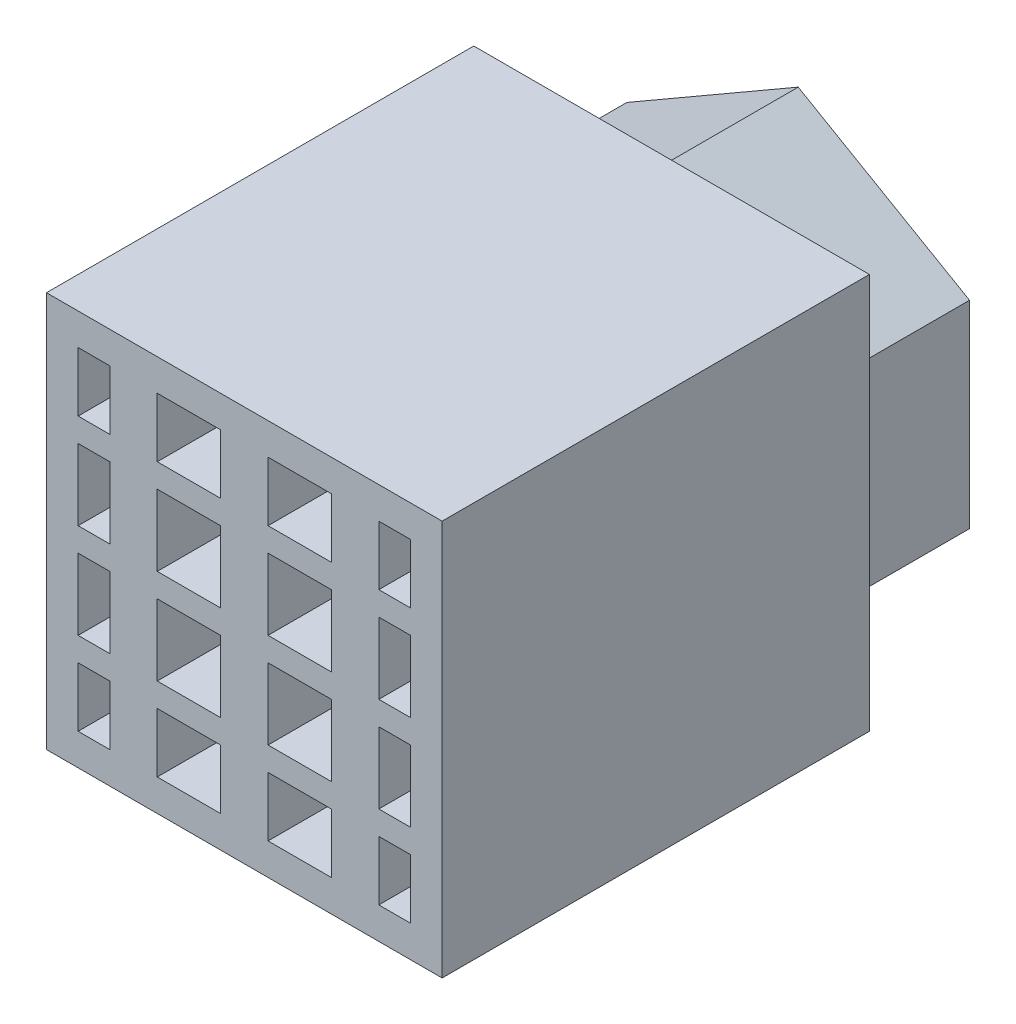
ISO-10303-21;
HEADER;
FILE_DESCRIPTION(('STEP AP214'),'2;1');
FILE_NAME('part.step','',(''),(''),'','','');
FILE_SCHEMA(('AUTOMOTIVE_DESIGN { 1 0 10303 214 1 1 1 1 }'));
ENDSEC;
DATA;
#1=APPLICATION_CONTEXT('core data for automotive mechanical design processes');
#2=APPLICATION_PROTOCOL_DEFINITION('international standard','automotive_design',2000,#1);
#3=PRODUCT_CONTEXT('',#1,'mechanical');
#4=PRODUCT('Part','Part','',(#3));
#5=PRODUCT_RELATED_PRODUCT_CATEGORY('part','',(#4));
#6=PRODUCT_DEFINITION_FORMATION('','',#4);
#7=PRODUCT_DEFINITION_CONTEXT('part definition',#1,'design');
#8=PRODUCT_DEFINITION('design','',#6,#7);
#9=PRODUCT_DEFINITION_SHAPE('','',#8);
#10=(LENGTH_UNIT() NAMED_UNIT(*) SI_UNIT(.MILLI.,.METRE.));
#11=(NAMED_UNIT(*) PLANE_ANGLE_UNIT() SI_UNIT($,.RADIAN.));
#12=(NAMED_UNIT(*) SI_UNIT($,.STERADIAN.) SOLID_ANGLE_UNIT());
#13=UNCERTAINTY_MEASURE_WITH_UNIT(LENGTH_MEASURE(1.E-05),#10,'distance_accuracy_value','');
#14=(GEOMETRIC_REPRESENTATION_CONTEXT(3) GLOBAL_UNCERTAINTY_ASSIGNED_CONTEXT((#13)) GLOBAL_UNIT_ASSIGNED_CONTEXT((#10,
#11,#12)) REPRESENTATION_CONTEXT('',''));
#15=CARTESIAN_POINT('',(0.,0.,0.));
#16=DIRECTION('',(0.,0.,1.));
#17=DIRECTION('',(1.,0.,0.));
#18=AXIS2_PLACEMENT_3D('',#15,#16,#17);
#19=CARTESIAN_POINT('',(0.,0.,-2.));
#20=DIRECTION('',(0.,0.,1.));
#21=DIRECTION('',(1.,0.,0.));
#22=AXIS2_PLACEMENT_3D('',#19,#20,#21);
#23=PLANE('',#22);
#24=DIRECTION('',(-0.866025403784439,-0.5,0.));
#25=VECTOR('',#24,1.);
#26=CARTESIAN_POINT('',(10.8253175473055,-6.25,-2.));
#27=LINE('',#26,#25);
#28=CARTESIAN_POINT('',(10.8253175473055,-6.25,-2.));
#29=VERTEX_POINT('',#28);
#30=CARTESIAN_POINT('',(0.,-12.5,-2.));
#31=VERTEX_POINT('',#30);
#32=EDGE_CURVE('E56',#29,#31,#27,.T.);
#33=ORIENTED_EDGE('',*,*,#32,.F.);
#34=DIRECTION('',(0.,-1.,0.));
#35=VECTOR('',#34,1.);
#36=CARTESIAN_POINT('',(10.8253175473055,6.25,-2.));
#37=LINE('',#36,#35);
#38=CARTESIAN_POINT('',(10.8253175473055,6.25,-2.));
#39=VERTEX_POINT('',#38);
#40=EDGE_CURVE('E60',#39,#29,#37,.T.);
#41=ORIENTED_EDGE('',*,*,#40,.F.);
#42=DIRECTION('',(0.866025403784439,-0.5,0.));
#43=VECTOR('',#42,1.);
#44=CARTESIAN_POINT('',(0.,12.5,-2.));
#45=LINE('',#44,#43);
#46=CARTESIAN_POINT('',(0.,12.5,-2.));
#47=VERTEX_POINT('',#46);
#48=EDGE_CURVE('E629',#47,#39,#45,.T.);
#49=ORIENTED_EDGE('',*,*,#48,.F.);
#50=DIRECTION('',(1.,0.,0.));
#51=VECTOR('',#50,1.);
#52=CARTESIAN_POINT('',(12.5,12.5,-2.));
#53=LINE('',#52,#51);
#54=CARTESIAN_POINT('',(12.5,12.5,-2.));
#55=VERTEX_POINT('',#54);
#56=EDGE_CURVE('E850',#47,#55,#53,.T.);
#57=ORIENTED_EDGE('',*,*,#56,.T.);
#58=DIRECTION('',(0.,-1.,0.));
#59=VECTOR('',#58,1.);
#60=CARTESIAN_POINT('',(12.5,-12.5,-2.));
#61=LINE('',#60,#59);
#62=CARTESIAN_POINT('',(12.5,-12.5,-2.));
#63=VERTEX_POINT('',#62);
#64=EDGE_CURVE('E854',#55,#63,#61,.T.);
#65=ORIENTED_EDGE('',*,*,#64,.T.);
#66=DIRECTION('',(-1.,0.,0.));
#67=VECTOR('',#66,1.);
#68=CARTESIAN_POINT('',(12.5,-12.5,-2.));
#69=LINE('',#68,#67);
#70=EDGE_CURVE('E858',#63,#31,#69,.T.);
#71=ORIENTED_EDGE('',*,*,#70,.T.);
#72=EDGE_LOOP('',(#33,#41,#49,#57,#65,#71));
#73=FACE_BOUND('',#72,.T.);
#74=ADVANCED_FACE('F40',(#73),#23,.F.);
#75=DIRECTION('',(0.866025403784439,0.5,0.));
#76=VECTOR('',#75,1.);
#77=CARTESIAN_POINT('',(-10.8253175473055,6.25,-2.));
#78=LINE('',#77,#76);
#79=CARTESIAN_POINT('',(-10.8253175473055,6.25,-2.));
#80=VERTEX_POINT('',#79);
#81=EDGE_CURVE('E544',#80,#47,#78,.T.);
#82=ORIENTED_EDGE('',*,*,#81,.F.);
#83=DIRECTION('',(0.,1.,0.));
#84=VECTOR('',#83,1.);
#85=CARTESIAN_POINT('',(-10.8253175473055,-6.25,-2.));
#86=LINE('',#85,#84);
#87=CARTESIAN_POINT('',(-10.8253175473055,-6.25,-2.));
#88=VERTEX_POINT('',#87);
#89=EDGE_CURVE('E625',#88,#80,#86,.T.);
#90=ORIENTED_EDGE('',*,*,#89,.F.);
#91=DIRECTION('',(-0.866025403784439,0.5,0.));
#92=VECTOR('',#91,1.);
#93=CARTESIAN_POINT('',(0.,-12.5,-2.));
#94=LINE('',#93,#92);
#95=EDGE_CURVE('E622',#31,#88,#94,.T.);
#96=ORIENTED_EDGE('',*,*,#95,.F.);
#97=CARTESIAN_POINT('',(-12.5,-12.5,-2.));
#98=VERTEX_POINT('',#97);
#99=EDGE_CURVE('E857',#31,#98,#69,.T.);
#100=ORIENTED_EDGE('',*,*,#99,.T.);
#101=DIRECTION('',(0.,1.,0.));
#102=VECTOR('',#101,1.);
#103=CARTESIAN_POINT('',(-12.5,-12.5,-2.));
#104=LINE('',#103,#102);
#105=CARTESIAN_POINT('',(-12.5,12.5,-2.));
#106=VERTEX_POINT('',#105);
#107=EDGE_CURVE('E847',#98,#106,#104,.T.);
#108=ORIENTED_EDGE('',*,*,#107,.T.);
#109=EDGE_CURVE('E851',#106,#47,#53,.T.);
#110=ORIENTED_EDGE('',*,*,#109,.T.);
#111=EDGE_LOOP('',(#82,#90,#96,#100,#108,#110));
#112=FACE_BOUND('',#111,.T.);
#113=ADVANCED_FACE('F1234',(#112),#23,.F.);
#114=CARTESIAN_POINT('',(-1.5,-10.5,25.));
#115=DIRECTION('',(-1.,0.,0.));
#116=DIRECTION('',(0.,0.,1.));
#117=AXIS2_PLACEMENT_3D('',#114,#115,#116);
#118=PLANE('',#117);
#119=DIRECTION('',(0.,0.,-1.));
#120=VECTOR('',#119,1.);
#121=CARTESIAN_POINT('',(-1.5,6.75,25.));
#122=LINE('',#121,#120);
#123=CARTESIAN_POINT('',(-1.5,6.75,25.));
#124=VERTEX_POINT('',#123);
#125=CARTESIAN_POINT('',(-1.5,6.75,0.));
#126=VERTEX_POINT('',#125);
#127=EDGE_CURVE('E708',#124,#126,#122,.T.);
#128=ORIENTED_EDGE('',*,*,#127,.F.);
#129=DIRECTION('',(0.,1.,0.));
#130=VECTOR('',#129,1.);
#131=CARTESIAN_POINT('',(-1.5,-10.5,25.));
#132=LINE('',#131,#130);
#133=CARTESIAN_POINT('',(-1.5,10.5,25.));
#134=VERTEX_POINT('',#133);
#135=EDGE_CURVE('E994',#124,#134,#132,.T.);
#136=ORIENTED_EDGE('',*,*,#135,.T.);
#137=DIRECTION('',(0.,0.,-1.));
#138=VECTOR('',#137,1.);
#139=CARTESIAN_POINT('',(-1.5,10.5,25.));
#140=LINE('',#139,#138);
#141=CARTESIAN_POINT('',(-1.5,10.5,0.));
#142=VERTEX_POINT('',#141);
#143=EDGE_CURVE('E1029',#134,#142,#140,.T.);
#144=ORIENTED_EDGE('',*,*,#143,.T.);
#145=DIRECTION('',(0.,1.,0.));
#146=VECTOR('',#145,1.);
#147=CARTESIAN_POINT('',(-1.5,-10.5,0.));
#148=LINE('',#147,#146);
#149=EDGE_CURVE('E989',#126,#142,#148,.T.);
#150=ORIENTED_EDGE('',*,*,#149,.F.);
#151=EDGE_LOOP('',(#128,#136,#144,#150));
#152=FACE_BOUND('',#151,.T.);
#153=ADVANCED_FACE('F1081',(#152),#118,.T.);
#154=CARTESIAN_POINT('',(-5.5,-10.5,25.));
#155=DIRECTION('',(1.,0.,0.));
#156=DIRECTION('',(0.,0.,-1.));
#157=AXIS2_PLACEMENT_3D('',#154,#155,#156);
#158=PLANE('',#157);
#159=DIRECTION('',(0.,0.,1.));
#160=VECTOR('',#159,1.);
#161=CARTESIAN_POINT('',(-5.5,6.75,25.));
#162=LINE('',#161,#160);
#163=CARTESIAN_POINT('',(-5.5,6.75,0.));
#164=VERTEX_POINT('',#163);
#165=CARTESIAN_POINT('',(-5.5,6.75,25.));
#166=VERTEX_POINT('',#165);
#167=EDGE_CURVE('E705',#164,#166,#162,.T.);
#168=ORIENTED_EDGE('',*,*,#167,.F.);
#169=DIRECTION('',(0.,-1.,0.));
#170=VECTOR('',#169,1.);
#171=CARTESIAN_POINT('',(-5.5,-10.5,0.));
#172=LINE('',#171,#170);
#173=CARTESIAN_POINT('',(-5.5,10.5,0.));
#174=VERTEX_POINT('',#173);
#175=EDGE_CURVE('E1014',#174,#164,#172,.T.);
#176=ORIENTED_EDGE('',*,*,#175,.F.);
#177=DIRECTION('',(0.,0.,-1.));
#178=VECTOR('',#177,1.);
#179=CARTESIAN_POINT('',(-5.5,10.5,25.));
#180=LINE('',#179,#178);
#181=CARTESIAN_POINT('',(-5.5,10.5,25.));
#182=VERTEX_POINT('',#181);
#183=EDGE_CURVE('E1027',#182,#174,#180,.T.);
#184=ORIENTED_EDGE('',*,*,#183,.F.);
#185=DIRECTION('',(0.,-1.,0.));
#186=VECTOR('',#185,1.);
#187=CARTESIAN_POINT('',(-5.5,-10.5,25.));
#188=LINE('',#187,#186);
#189=EDGE_CURVE('E998',#182,#166,#188,.T.);
#190=ORIENTED_EDGE('',*,*,#189,.T.);
#191=EDGE_LOOP('',(#168,#176,#184,#190));
#192=FACE_BOUND('',#191,.T.);
#193=ADVANCED_FACE('F1513',(#192),#158,.T.);
#194=CARTESIAN_POINT('',(-8.5,-10.5,25.));
#195=DIRECTION('',(-1.,0.,0.));
#196=DIRECTION('',(0.,0.,1.));
#197=AXIS2_PLACEMENT_3D('',#194,#195,#196);
#198=PLANE('',#197);
#199=DIRECTION('',(0.,0.,-1.));
#200=VECTOR('',#199,1.);
#201=CARTESIAN_POINT('',(-8.5,6.75,25.));
#202=LINE('',#201,#200);
#203=CARTESIAN_POINT('',(-8.5,6.74999999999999,25.));
#204=VERTEX_POINT('',#203);
#205=CARTESIAN_POINT('',(-8.5,6.74999999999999,0.));
#206=VERTEX_POINT('',#205);
#207=EDGE_CURVE('E702',#204,#206,#202,.T.);
#208=ORIENTED_EDGE('',*,*,#207,.F.);
#209=DIRECTION('',(0.,1.,0.));
#210=VECTOR('',#209,1.);
#211=CARTESIAN_POINT('',(-8.5,-10.5,25.));
#212=LINE('',#211,#210);
#213=CARTESIAN_POINT('',(-8.5,10.5,25.));
#214=VERTEX_POINT('',#213);
#215=EDGE_CURVE('E951',#204,#214,#212,.T.);
#216=ORIENTED_EDGE('',*,*,#215,.T.);
#217=DIRECTION('',(0.,0.,-1.));
#218=VECTOR('',#217,1.);
#219=CARTESIAN_POINT('',(-8.5,10.5,25.));
#220=LINE('',#219,#218);
#221=CARTESIAN_POINT('',(-8.5,10.5,0.));
#222=VERTEX_POINT('',#221);
#223=EDGE_CURVE('E986',#214,#222,#220,.T.);
#224=ORIENTED_EDGE('',*,*,#223,.T.);
#225=DIRECTION('',(0.,1.,0.));
#226=VECTOR('',#225,1.);
#227=CARTESIAN_POINT('',(-8.5,-10.5,0.));
#228=LINE('',#227,#226);
#229=EDGE_CURVE('E946',#206,#222,#228,.T.);
#230=ORIENTED_EDGE('',*,*,#229,.F.);
#231=EDGE_LOOP('',(#208,#216,#224,#230));
#232=FACE_BOUND('',#231,.T.);
#233=ADVANCED_FACE('F1390',(#232),#198,.T.);
#234=CARTESIAN_POINT('',(-10.5,-10.5,25.));
#235=DIRECTION('',(1.,0.,0.));
#236=DIRECTION('',(0.,0.,-1.));
#237=AXIS2_PLACEMENT_3D('',#234,#235,#236);
#238=PLANE('',#237);
#239=DIRECTION('',(0.,0.,1.));
#240=VECTOR('',#239,1.);
#241=CARTESIAN_POINT('',(-10.5,6.75,25.));
#242=LINE('',#241,#240);
#243=CARTESIAN_POINT('',(-10.5,6.75,0.));
#244=VERTEX_POINT('',#243);
#245=CARTESIAN_POINT('',(-10.5,6.75,25.));
#246=VERTEX_POINT('',#245);
#247=EDGE_CURVE('E699',#244,#246,#242,.T.);
#248=ORIENTED_EDGE('',*,*,#247,.F.);
#249=DIRECTION('',(0.,-1.,0.));
#250=VECTOR('',#249,1.);
#251=CARTESIAN_POINT('',(-10.5,-10.5,0.));
#252=LINE('',#251,#250);
#253=CARTESIAN_POINT('',(-10.5,10.5,0.));
#254=VERTEX_POINT('',#253);
#255=EDGE_CURVE('E971',#254,#244,#252,.T.);
#256=ORIENTED_EDGE('',*,*,#255,.F.);
#257=DIRECTION('',(0.,0.,-1.));
#258=VECTOR('',#257,1.);
#259=CARTESIAN_POINT('',(-10.5,10.5,25.));
#260=LINE('',#259,#258);
#261=CARTESIAN_POINT('',(-10.5,10.5,25.));
#262=VERTEX_POINT('',#261);
#263=EDGE_CURVE('E984',#262,#254,#260,.T.);
#264=ORIENTED_EDGE('',*,*,#263,.F.);
#265=DIRECTION('',(0.,-1.,0.));
#266=VECTOR('',#265,1.);
#267=CARTESIAN_POINT('',(-10.5,-10.5,25.));
#268=LINE('',#267,#266);
#269=EDGE_CURVE('E955',#262,#246,#268,.T.);
#270=ORIENTED_EDGE('',*,*,#269,.T.);
#271=EDGE_LOOP('',(#248,#256,#264,#270));
#272=FACE_BOUND('',#271,.T.);
#273=ADVANCED_FACE('F1401',(#272),#238,.T.);
#274=CARTESIAN_POINT('',(5.5,-10.5,25.));
#275=DIRECTION('',(-1.,0.,0.));
#276=DIRECTION('',(0.,-1.,0.));
#277=AXIS2_PLACEMENT_3D('',#274,#275,#276);
#278=PLANE('',#277);
#279=DIRECTION('',(0.,0.,-1.));
#280=VECTOR('',#279,1.);
#281=CARTESIAN_POINT('',(5.5,6.75,25.));
#282=LINE('',#281,#280);
#283=CARTESIAN_POINT('',(5.5,6.75,25.));
#284=VERTEX_POINT('',#283);
#285=CARTESIAN_POINT('',(5.5,6.75,0.));
#286=VERTEX_POINT('',#285);
#287=EDGE_CURVE('E696',#284,#286,#282,.T.);
#288=ORIENTED_EDGE('',*,*,#287,.F.);
#289=DIRECTION('',(0.,1.,0.));
#290=VECTOR('',#289,1.);
#291=CARTESIAN_POINT('',(5.5,-10.5,25.));
#292=LINE('',#291,#290);
#293=CARTESIAN_POINT('',(5.5,10.5,25.));
#294=VERTEX_POINT('',#293);
#295=EDGE_CURVE('E908',#284,#294,#292,.T.);
#296=ORIENTED_EDGE('',*,*,#295,.T.);
#297=DIRECTION('',(0.,0.,-1.));
#298=VECTOR('',#297,1.);
#299=CARTESIAN_POINT('',(5.5,10.5,25.));
#300=LINE('',#299,#298);
#301=CARTESIAN_POINT('',(5.5,10.5,0.));
#302=VERTEX_POINT('',#301);
#303=EDGE_CURVE('E943',#294,#302,#300,.T.);
#304=ORIENTED_EDGE('',*,*,#303,.T.);
#305=DIRECTION('',(0.,1.,0.));
#306=VECTOR('',#305,1.);
#307=CARTESIAN_POINT('',(5.5,-10.5,0.));
#308=LINE('',#307,#306);
#309=EDGE_CURVE('E903',#286,#302,#308,.T.);
#310=ORIENTED_EDGE('',*,*,#309,.F.);
#311=EDGE_LOOP('',(#288,#296,#304,#310));
#312=FACE_BOUND('',#311,.T.);
#313=ADVANCED_FACE('F1113',(#312),#278,.T.);
#314=CARTESIAN_POINT('',(1.5,-10.5,25.));
#315=DIRECTION('',(1.,0.,0.));
#316=DIRECTION('',(0.,1.,0.));
#317=AXIS2_PLACEMENT_3D('',#314,#315,#316);
#318=PLANE('',#317);
#319=DIRECTION('',(0.,0.,1.));
#320=VECTOR('',#319,1.);
#321=CARTESIAN_POINT('',(1.5,6.75,25.));
#322=LINE('',#321,#320);
#323=CARTESIAN_POINT('',(1.5,6.75,0.));
#324=VERTEX_POINT('',#323);
#325=CARTESIAN_POINT('',(1.5,6.75,25.));
#326=VERTEX_POINT('',#325);
#327=EDGE_CURVE('E693',#324,#326,#322,.T.);
#328=ORIENTED_EDGE('',*,*,#327,.F.);
#329=DIRECTION('',(0.,-1.,0.));
#330=VECTOR('',#329,1.);
#331=CARTESIAN_POINT('',(1.5,-10.5,0.));
#332=LINE('',#331,#330);
#333=CARTESIAN_POINT('',(1.5,10.5,0.));
#334=VERTEX_POINT('',#333);
#335=EDGE_CURVE('E928',#334,#324,#332,.T.);
#336=ORIENTED_EDGE('',*,*,#335,.F.);
#337=DIRECTION('',(0.,0.,-1.));
#338=VECTOR('',#337,1.);
#339=CARTESIAN_POINT('',(1.5,10.5,25.));
#340=LINE('',#339,#338);
#341=CARTESIAN_POINT('',(1.5,10.5,25.));
#342=VERTEX_POINT('',#341);
#343=EDGE_CURVE('E941',#342,#334,#340,.T.);
#344=ORIENTED_EDGE('',*,*,#343,.F.);
#345=DIRECTION('',(0.,-1.,0.));
#346=VECTOR('',#345,1.);
#347=CARTESIAN_POINT('',(1.5,-10.5,25.));
#348=LINE('',#347,#346);
#349=EDGE_CURVE('E912',#342,#326,#348,.T.);
#350=ORIENTED_EDGE('',*,*,#349,.T.);
#351=EDGE_LOOP('',(#328,#336,#344,#350));
#352=FACE_BOUND('',#351,.T.);
#353=ADVANCED_FACE('F1127',(#352),#318,.T.);
#354=CARTESIAN_POINT('',(10.5,-10.5,25.));
#355=DIRECTION('',(-1.,0.,0.));
#356=DIRECTION('',(0.,-1.,0.));
#357=AXIS2_PLACEMENT_3D('',#354,#355,#356);
#358=PLANE('',#357);
#359=DIRECTION('',(0.,0.,-1.));
#360=VECTOR('',#359,1.);
#361=CARTESIAN_POINT('',(10.5,6.75,25.));
#362=LINE('',#361,#360);
#363=CARTESIAN_POINT('',(10.5,6.75,25.));
#364=VERTEX_POINT('',#363);
#365=CARTESIAN_POINT('',(10.5,6.75,0.));
#366=VERTEX_POINT('',#365);
#367=EDGE_CURVE('E690',#364,#366,#362,.T.);
#368=ORIENTED_EDGE('',*,*,#367,.F.);
#369=DIRECTION('',(0.,1.,0.));
#370=VECTOR('',#369,1.);
#371=CARTESIAN_POINT('',(10.5,-10.5,25.));
#372=LINE('',#371,#370);
#373=CARTESIAN_POINT('',(10.5,10.5,25.));
#374=VERTEX_POINT('',#373);
#375=EDGE_CURVE('E865',#364,#374,#372,.T.);
#376=ORIENTED_EDGE('',*,*,#375,.T.);
#377=DIRECTION('',(0.,0.,-1.));
#378=VECTOR('',#377,1.);
#379=CARTESIAN_POINT('',(10.5,10.5,25.));
#380=LINE('',#379,#378);
#381=CARTESIAN_POINT('',(10.5,10.5,0.));
#382=VERTEX_POINT('',#381);
#383=EDGE_CURVE('E900',#374,#382,#380,.T.);
#384=ORIENTED_EDGE('',*,*,#383,.T.);
#385=DIRECTION('',(0.,1.,0.));
#386=VECTOR('',#385,1.);
#387=CARTESIAN_POINT('',(10.5,-10.5,0.));
#388=LINE('',#387,#386);
#389=EDGE_CURVE('E860',#366,#382,#388,.T.);
#390=ORIENTED_EDGE('',*,*,#389,.F.);
#391=EDGE_LOOP('',(#368,#376,#384,#390));
#392=FACE_BOUND('',#391,.T.);
#393=ADVANCED_FACE('F1158',(#392),#358,.T.);
#394=CARTESIAN_POINT('',(8.5,-10.5,25.));
#395=DIRECTION('',(1.,0.,0.));
#396=DIRECTION('',(0.,1.,0.));
#397=AXIS2_PLACEMENT_3D('',#394,#395,#396);
#398=PLANE('',#397);
#399=DIRECTION('',(0.,0.,1.));
#400=VECTOR('',#399,1.);
#401=CARTESIAN_POINT('',(8.5,6.75,25.));
#402=LINE('',#401,#400);
#403=CARTESIAN_POINT('',(8.5,6.74999999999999,0.));
#404=VERTEX_POINT('',#403);
#405=CARTESIAN_POINT('',(8.5,6.74999999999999,25.));
#406=VERTEX_POINT('',#405);
#407=EDGE_CURVE('E687',#404,#406,#402,.T.);
#408=ORIENTED_EDGE('',*,*,#407,.F.);
#409=DIRECTION('',(0.,-1.,0.));
#410=VECTOR('',#409,1.);
#411=CARTESIAN_POINT('',(8.5,-10.5,0.));
#412=LINE('',#411,#410);
#413=CARTESIAN_POINT('',(8.5,10.5,0.));
#414=VERTEX_POINT('',#413);
#415=EDGE_CURVE('E885',#414,#404,#412,.T.);
#416=ORIENTED_EDGE('',*,*,#415,.F.);
#417=DIRECTION('',(0.,0.,-1.));
#418=VECTOR('',#417,1.);
#419=CARTESIAN_POINT('',(8.5,10.5,25.));
#420=LINE('',#419,#418);
#421=CARTESIAN_POINT('',(8.5,10.5,25.));
#422=VERTEX_POINT('',#421);
#423=EDGE_CURVE('E898',#422,#414,#420,.T.);
#424=ORIENTED_EDGE('',*,*,#423,.F.);
#425=DIRECTION('',(0.,-1.,0.));
#426=VECTOR('',#425,1.);
#427=CARTESIAN_POINT('',(8.5,-10.5,25.));
#428=LINE('',#427,#426);
#429=EDGE_CURVE('E869',#422,#406,#428,.T.);
#430=ORIENTED_EDGE('',*,*,#429,.T.);
#431=EDGE_LOOP('',(#408,#416,#424,#430));
#432=FACE_BOUND('',#431,.T.);
#433=ADVANCED_FACE('F1148',(#432),#398,.T.);
#434=CARTESIAN_POINT('',(0.,0.,0.));
#435=DIRECTION('',(0.,0.,1.));
#436=DIRECTION('',(1.,0.,0.));
#437=AXIS2_PLACEMENT_3D('',#434,#435,#436);
#438=PLANE('',#437);
#439=DIRECTION('',(-1.,0.,0.));
#440=VECTOR('',#439,1.);
#441=CARTESIAN_POINT('',(12.5,6.75,0.));
#442=LINE('',#441,#440);
#443=EDGE_CURVE('E654',#366,#404,#442,.T.);
#444=ORIENTED_EDGE('',*,*,#443,.F.);
#445=ORIENTED_EDGE('',*,*,#389,.T.);
#446=DIRECTION('',(-1.,0.,0.));
#447=VECTOR('',#446,1.);
#448=CARTESIAN_POINT('',(10.5,10.5,0.));
#449=LINE('',#448,#447);
#450=EDGE_CURVE('E879',#382,#414,#449,.T.);
#451=ORIENTED_EDGE('',*,*,#450,.T.);
#452=ORIENTED_EDGE('',*,*,#415,.T.);
#453=EDGE_LOOP('',(#444,#445,#451,#452));
#454=FACE_BOUND('',#453,.T.);
#455=ADVANCED_FACE('F1151',(#454),#438,.T.);
#456=EDGE_CURVE('E1132',#286,#324,#442,.T.);
#457=ORIENTED_EDGE('',*,*,#456,.F.);
#458=ORIENTED_EDGE('',*,*,#309,.T.);
#459=DIRECTION('',(-1.,0.,0.));
#460=VECTOR('',#459,1.);
#461=CARTESIAN_POINT('',(5.5,10.5,0.));
#462=LINE('',#461,#460);
#463=EDGE_CURVE('E922',#302,#334,#462,.T.);
#464=ORIENTED_EDGE('',*,*,#463,.T.);
#465=ORIENTED_EDGE('',*,*,#335,.T.);
#466=EDGE_LOOP('',(#457,#458,#464,#465));
#467=FACE_BOUND('',#466,.T.);
#468=ADVANCED_FACE('F1221',(#467),#438,.T.);
#469=EDGE_CURVE('E650',#206,#244,#442,.T.);
#470=ORIENTED_EDGE('',*,*,#469,.F.);
#471=ORIENTED_EDGE('',*,*,#229,.T.);
#472=DIRECTION('',(-1.,0.,0.));
#473=VECTOR('',#472,1.);
#474=CARTESIAN_POINT('',(-10.5,10.5,0.));
#475=LINE('',#474,#473);
#476=EDGE_CURVE('E965',#222,#254,#475,.T.);
#477=ORIENTED_EDGE('',*,*,#476,.T.);
#478=ORIENTED_EDGE('',*,*,#255,.T.);
#479=EDGE_LOOP('',(#470,#471,#477,#478));
#480=FACE_BOUND('',#479,.T.);
#481=ADVANCED_FACE('F1223',(#480),#438,.T.);
#482=EDGE_CURVE('E653',#126,#164,#442,.T.);
#483=ORIENTED_EDGE('',*,*,#482,.F.);
#484=ORIENTED_EDGE('',*,*,#149,.T.);
#485=DIRECTION('',(-1.,0.,0.));
#486=VECTOR('',#485,1.);
#487=CARTESIAN_POINT('',(-5.5,10.5,0.));
#488=LINE('',#487,#486);
#489=EDGE_CURVE('E1008',#142,#174,#488,.T.);
#490=ORIENTED_EDGE('',*,*,#489,.T.);
#491=ORIENTED_EDGE('',*,*,#175,.T.);
#492=EDGE_LOOP('',(#483,#484,#490,#491));
#493=FACE_BOUND('',#492,.T.);
#494=ADVANCED_FACE('F1072',(#493),#438,.T.);
#495=DIRECTION('',(0.,0.,1.));
#496=VECTOR('',#495,1.);
#497=CARTESIAN_POINT('',(-1.5,-6.75,25.));
#498=LINE('',#497,#496);
#499=CARTESIAN_POINT('',(-1.5,-6.75,0.));
#500=VERTEX_POINT('',#499);
#501=CARTESIAN_POINT('',(-1.5,-6.75,25.));
#502=VERTEX_POINT('',#501);
#503=EDGE_CURVE('E776',#500,#502,#498,.T.);
#504=ORIENTED_EDGE('',*,*,#503,.F.);
#505=CARTESIAN_POINT('',(-1.5,-10.5,0.));
#506=VERTEX_POINT('',#505);
#507=EDGE_CURVE('E1005',#506,#500,#148,.T.);
#508=ORIENTED_EDGE('',*,*,#507,.F.);
#509=DIRECTION('',(0.,0.,-1.));
#510=VECTOR('',#509,1.);
#511=CARTESIAN_POINT('',(-1.5,-10.5,25.));
#512=LINE('',#511,#510);
#513=CARTESIAN_POINT('',(-1.5,-10.5,25.));
#514=VERTEX_POINT('',#513);
#515=EDGE_CURVE('E1004',#514,#506,#512,.T.);
#516=ORIENTED_EDGE('',*,*,#515,.F.);
#517=EDGE_CURVE('E990',#514,#502,#132,.T.);
#518=ORIENTED_EDGE('',*,*,#517,.T.);
#519=EDGE_LOOP('',(#504,#508,#516,#518));
#520=FACE_BOUND('',#519,.T.);
#521=ADVANCED_FACE('F1626',(#520),#118,.T.);
#522=DIRECTION('',(0.,0.,-1.));
#523=VECTOR('',#522,1.);
#524=CARTESIAN_POINT('',(-5.5,-6.75,25.));
#525=LINE('',#524,#523);
#526=CARTESIAN_POINT('',(-5.5,-6.75,25.));
#527=VERTEX_POINT('',#526);
#528=CARTESIAN_POINT('',(-5.5,-6.75,0.));
#529=VERTEX_POINT('',#528);
#530=EDGE_CURVE('E773',#527,#529,#525,.T.);
#531=ORIENTED_EDGE('',*,*,#530,.F.);
#532=CARTESIAN_POINT('',(-5.5,-10.5,25.));
#533=VERTEX_POINT('',#532);
#534=EDGE_CURVE('E997',#527,#533,#188,.T.);
#535=ORIENTED_EDGE('',*,*,#534,.T.);
#536=DIRECTION('',(0.,0.,-1.));
#537=VECTOR('',#536,1.);
#538=CARTESIAN_POINT('',(-5.5,-10.5,25.));
#539=LINE('',#538,#537);
#540=CARTESIAN_POINT('',(-5.5,-10.5,0.));
#541=VERTEX_POINT('',#540);
#542=EDGE_CURVE('E1024',#533,#541,#539,.T.);
#543=ORIENTED_EDGE('',*,*,#542,.T.);
#544=EDGE_CURVE('E1013',#529,#541,#172,.T.);
#545=ORIENTED_EDGE('',*,*,#544,.F.);
#546=EDGE_LOOP('',(#531,#535,#543,#545));
#547=FACE_BOUND('',#546,.T.);
#548=ADVANCED_FACE('F1620',(#547),#158,.T.);
#549=DIRECTION('',(0.,0.,1.));
#550=VECTOR('',#549,1.);
#551=CARTESIAN_POINT('',(-8.5,-6.75,25.));
#552=LINE('',#551,#550);
#553=CARTESIAN_POINT('',(-8.5,-6.75,0.));
#554=VERTEX_POINT('',#553);
#555=CARTESIAN_POINT('',(-8.5,-6.75,25.));
#556=VERTEX_POINT('',#555);
#557=EDGE_CURVE('E770',#554,#556,#552,.T.);
#558=ORIENTED_EDGE('',*,*,#557,.F.);
#559=CARTESIAN_POINT('',(-8.5,-10.5,0.));
#560=VERTEX_POINT('',#559);
#561=EDGE_CURVE('E962',#560,#554,#228,.T.);
#562=ORIENTED_EDGE('',*,*,#561,.F.);
#563=DIRECTION('',(0.,0.,-1.));
#564=VECTOR('',#563,1.);
#565=CARTESIAN_POINT('',(-8.5,-10.5,25.));
#566=LINE('',#565,#564);
#567=CARTESIAN_POINT('',(-8.5,-10.5,25.));
#568=VERTEX_POINT('',#567);
#569=EDGE_CURVE('E961',#568,#560,#566,.T.);
#570=ORIENTED_EDGE('',*,*,#569,.F.);
#571=EDGE_CURVE('E947',#568,#556,#212,.T.);
#572=ORIENTED_EDGE('',*,*,#571,.T.);
#573=EDGE_LOOP('',(#558,#562,#570,#572));
#574=FACE_BOUND('',#573,.T.);
#575=ADVANCED_FACE('F1613',(#574),#198,.T.);
#576=DIRECTION('',(0.,0.,-1.));
#577=VECTOR('',#576,1.);
#578=CARTESIAN_POINT('',(-10.5,-6.75,25.));
#579=LINE('',#578,#577);
#580=CARTESIAN_POINT('',(-10.5,-6.75,25.));
#581=VERTEX_POINT('',#580);
#582=CARTESIAN_POINT('',(-10.5,-6.75,0.));
#583=VERTEX_POINT('',#582);
#584=EDGE_CURVE('E767',#581,#583,#579,.T.);
#585=ORIENTED_EDGE('',*,*,#584,.F.);
#586=CARTESIAN_POINT('',(-10.5,-10.5,25.));
#587=VERTEX_POINT('',#586);
#588=EDGE_CURVE('E954',#581,#587,#268,.T.);
#589=ORIENTED_EDGE('',*,*,#588,.T.);
#590=DIRECTION('',(0.,0.,-1.));
#591=VECTOR('',#590,1.);
#592=CARTESIAN_POINT('',(-10.5,-10.5,25.));
#593=LINE('',#592,#591);
#594=CARTESIAN_POINT('',(-10.5,-10.5,0.));
#595=VERTEX_POINT('',#594);
#596=EDGE_CURVE('E981',#587,#595,#593,.T.);
#597=ORIENTED_EDGE('',*,*,#596,.T.);
#598=EDGE_CURVE('E970',#583,#595,#252,.T.);
#599=ORIENTED_EDGE('',*,*,#598,.F.);
#600=EDGE_LOOP('',(#585,#589,#597,#599));
#601=FACE_BOUND('',#600,.T.);
#602=ADVANCED_FACE('F1370',(#601),#238,.T.);
#603=DIRECTION('',(0.,0.,1.));
#604=VECTOR('',#603,1.);
#605=CARTESIAN_POINT('',(5.5,-6.75,25.));
#606=LINE('',#605,#604);
#607=CARTESIAN_POINT('',(5.5,-6.75,0.));
#608=VERTEX_POINT('',#607);
#609=CARTESIAN_POINT('',(5.5,-6.75,25.));
#610=VERTEX_POINT('',#609);
#611=EDGE_CURVE('E764',#608,#610,#606,.T.);
#612=ORIENTED_EDGE('',*,*,#611,.F.);
#613=CARTESIAN_POINT('',(5.5,-10.5,0.));
#614=VERTEX_POINT('',#613);
#615=EDGE_CURVE('E919',#614,#608,#308,.T.);
#616=ORIENTED_EDGE('',*,*,#615,.F.);
#617=DIRECTION('',(0.,0.,-1.));
#618=VECTOR('',#617,1.);
#619=CARTESIAN_POINT('',(5.5,-10.5,25.));
#620=LINE('',#619,#618);
#621=CARTESIAN_POINT('',(5.5,-10.5,25.));
#622=VERTEX_POINT('',#621);
#623=EDGE_CURVE('E918',#622,#614,#620,.T.);
#624=ORIENTED_EDGE('',*,*,#623,.F.);
#625=EDGE_CURVE('E904',#622,#610,#292,.T.);
#626=ORIENTED_EDGE('',*,*,#625,.T.);
#627=EDGE_LOOP('',(#612,#616,#624,#626));
#628=FACE_BOUND('',#627,.T.);
#629=ADVANCED_FACE('F1602',(#628),#278,.T.);
#630=DIRECTION('',(0.,0.,-1.));
#631=VECTOR('',#630,1.);
#632=CARTESIAN_POINT('',(1.5,-6.75,25.));
#633=LINE('',#632,#631);
#634=CARTESIAN_POINT('',(1.5,-6.75,25.));
#635=VERTEX_POINT('',#634);
#636=CARTESIAN_POINT('',(1.5,-6.75,0.));
#637=VERTEX_POINT('',#636);
#638=EDGE_CURVE('E761',#635,#637,#633,.T.);
#639=ORIENTED_EDGE('',*,*,#638,.F.);
#640=CARTESIAN_POINT('',(1.5,-10.5,25.));
#641=VERTEX_POINT('',#640);
#642=EDGE_CURVE('E911',#635,#641,#348,.T.);
#643=ORIENTED_EDGE('',*,*,#642,.T.);
#644=DIRECTION('',(0.,0.,-1.));
#645=VECTOR('',#644,1.);
#646=CARTESIAN_POINT('',(1.5,-10.5,25.));
#647=LINE('',#646,#645);
#648=CARTESIAN_POINT('',(1.5,-10.5,0.));
#649=VERTEX_POINT('',#648);
#650=EDGE_CURVE('E938',#641,#649,#647,.T.);
#651=ORIENTED_EDGE('',*,*,#650,.T.);
#652=EDGE_CURVE('E927',#637,#649,#332,.T.);
#653=ORIENTED_EDGE('',*,*,#652,.F.);
#654=EDGE_LOOP('',(#639,#643,#651,#653));
#655=FACE_BOUND('',#654,.T.);
#656=ADVANCED_FACE('F1432',(#655),#318,.T.);
#657=DIRECTION('',(0.,0.,1.));
#658=VECTOR('',#657,1.);
#659=CARTESIAN_POINT('',(10.5,-6.75,25.));
#660=LINE('',#659,#658);
#661=CARTESIAN_POINT('',(10.5,-6.75,0.));
#662=VERTEX_POINT('',#661);
#663=CARTESIAN_POINT('',(10.5,-6.75,25.));
#664=VERTEX_POINT('',#663);
#665=EDGE_CURVE('E758',#662,#664,#660,.T.);
#666=ORIENTED_EDGE('',*,*,#665,.F.);
#667=CARTESIAN_POINT('',(10.5,-10.5,0.));
#668=VERTEX_POINT('',#667);
#669=EDGE_CURVE('E876',#668,#662,#388,.T.);
#670=ORIENTED_EDGE('',*,*,#669,.F.);
#671=DIRECTION('',(0.,0.,-1.));
#672=VECTOR('',#671,1.);
#673=CARTESIAN_POINT('',(10.5,-10.5,25.));
#674=LINE('',#673,#672);
#675=CARTESIAN_POINT('',(10.5,-10.5,25.));
#676=VERTEX_POINT('',#675);
#677=EDGE_CURVE('E875',#676,#668,#674,.T.);
#678=ORIENTED_EDGE('',*,*,#677,.F.);
#679=EDGE_CURVE('E861',#676,#664,#372,.T.);
#680=ORIENTED_EDGE('',*,*,#679,.T.);
#681=EDGE_LOOP('',(#666,#670,#678,#680));
#682=FACE_BOUND('',#681,.T.);
#683=ADVANCED_FACE('F1188',(#682),#358,.T.);
#684=DIRECTION('',(0.,0.,-1.));
#685=VECTOR('',#684,1.);
#686=CARTESIAN_POINT('',(8.5,-6.75,25.));
#687=LINE('',#686,#685);
#688=CARTESIAN_POINT('',(8.5,-6.75,25.));
#689=VERTEX_POINT('',#688);
#690=CARTESIAN_POINT('',(8.5,-6.75,0.));
#691=VERTEX_POINT('',#690);
#692=EDGE_CURVE('E755',#689,#691,#687,.T.);
#693=ORIENTED_EDGE('',*,*,#692,.F.);
#694=CARTESIAN_POINT('',(8.5,-10.5,25.));
#695=VERTEX_POINT('',#694);
#696=EDGE_CURVE('E868',#689,#695,#428,.T.);
#697=ORIENTED_EDGE('',*,*,#696,.T.);
#698=DIRECTION('',(0.,0.,-1.));
#699=VECTOR('',#698,1.);
#700=CARTESIAN_POINT('',(8.5,-10.5,25.));
#701=LINE('',#700,#699);
#702=CARTESIAN_POINT('',(8.5,-10.5,0.));
#703=VERTEX_POINT('',#702);
#704=EDGE_CURVE('E895',#695,#703,#701,.T.);
#705=ORIENTED_EDGE('',*,*,#704,.T.);
#706=EDGE_CURVE('E884',#691,#703,#412,.T.);
#707=ORIENTED_EDGE('',*,*,#706,.F.);
#708=EDGE_LOOP('',(#693,#697,#705,#707));
#709=FACE_BOUND('',#708,.T.);
#710=ADVANCED_FACE('F1176',(#709),#398,.T.);
#711=DIRECTION('',(1.,0.,0.));
#712=VECTOR('',#711,1.);
#713=CARTESIAN_POINT('',(12.5,-6.75,0.));
#714=LINE('',#713,#712);
#715=EDGE_CURVE('E718',#691,#662,#714,.T.);
#716=ORIENTED_EDGE('',*,*,#715,.F.);
#717=ORIENTED_EDGE('',*,*,#706,.T.);
#718=DIRECTION('',(1.,0.,0.));
#719=VECTOR('',#718,1.);
#720=CARTESIAN_POINT('',(10.5,-10.5,0.));
#721=LINE('',#720,#719);
#722=EDGE_CURVE('E888',#703,#668,#721,.T.);
#723=ORIENTED_EDGE('',*,*,#722,.T.);
#724=ORIENTED_EDGE('',*,*,#669,.T.);
#725=EDGE_LOOP('',(#716,#717,#723,#724));
#726=FACE_BOUND('',#725,.T.);
#727=ADVANCED_FACE('F1192',(#726),#438,.T.);
#728=EDGE_CURVE('E721',#637,#608,#714,.T.);
#729=ORIENTED_EDGE('',*,*,#728,.F.);
#730=ORIENTED_EDGE('',*,*,#652,.T.);
#731=DIRECTION('',(1.,0.,0.));
#732=VECTOR('',#731,1.);
#733=CARTESIAN_POINT('',(5.5,-10.5,0.));
#734=LINE('',#733,#732);
#735=EDGE_CURVE('E931',#649,#614,#734,.T.);
#736=ORIENTED_EDGE('',*,*,#735,.T.);
#737=ORIENTED_EDGE('',*,*,#615,.T.);
#738=EDGE_LOOP('',(#729,#730,#736,#737));
#739=FACE_BOUND('',#738,.T.);
#740=ADVANCED_FACE('F1424',(#739),#438,.T.);
#741=EDGE_CURVE('E722',#583,#554,#714,.T.);
#742=ORIENTED_EDGE('',*,*,#741,.F.);
#743=ORIENTED_EDGE('',*,*,#598,.T.);
#744=DIRECTION('',(1.,0.,0.));
#745=VECTOR('',#744,1.);
#746=CARTESIAN_POINT('',(-10.5,-10.5,0.));
#747=LINE('',#746,#745);
#748=EDGE_CURVE('E974',#595,#560,#747,.T.);
#749=ORIENTED_EDGE('',*,*,#748,.T.);
#750=ORIENTED_EDGE('',*,*,#561,.T.);
#751=EDGE_LOOP('',(#742,#743,#749,#750));
#752=FACE_BOUND('',#751,.T.);
#753=ADVANCED_FACE('F1362',(#752),#438,.T.);
#754=DIRECTION('',(1.,0.,0.));
#755=VECTOR('',#754,1.);
#756=CARTESIAN_POINT('',(0.,-6.75,0.));
#757=LINE('',#756,#755);
#758=EDGE_CURVE('E11',#529,#500,#757,.T.);
#759=ORIENTED_EDGE('',*,*,#758,.F.);
#760=ORIENTED_EDGE('',*,*,#544,.T.);
#761=DIRECTION('',(1.,0.,0.));
#762=VECTOR('',#761,1.);
#763=CARTESIAN_POINT('',(-5.5,-10.5,0.));
#764=LINE('',#763,#762);
#765=EDGE_CURVE('E1017',#541,#506,#764,.T.);
#766=ORIENTED_EDGE('',*,*,#765,.T.);
#767=ORIENTED_EDGE('',*,*,#507,.T.);
#768=EDGE_LOOP('',(#759,#760,#766,#767));
#769=FACE_BOUND('',#768,.T.);
#770=ADVANCED_FACE('F1581',(#769),#438,.T.);
#771=DIRECTION('',(0.,0.,1.));
#772=VECTOR('',#771,1.);
#773=CARTESIAN_POINT('',(-1.5,5.25,25.));
#774=LINE('',#773,#772);
#775=CARTESIAN_POINT('',(-1.5,5.25,0.));
#776=VERTEX_POINT('',#775);
#777=CARTESIAN_POINT('',(-1.5,5.25,25.));
#778=VERTEX_POINT('',#777);
#779=EDGE_CURVE('E684',#776,#778,#774,.T.);
#780=ORIENTED_EDGE('',*,*,#779,.F.);
#781=CARTESIAN_POINT('',(-1.5,0.750000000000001,0.));
#782=VERTEX_POINT('',#781);
#783=EDGE_CURVE('E1010',#782,#776,#148,.T.);
#784=ORIENTED_EDGE('',*,*,#783,.F.);
#785=DIRECTION('',(0.,0.,-1.));
#786=VECTOR('',#785,1.);
#787=CARTESIAN_POINT('',(-1.5,0.750000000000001,25.));
#788=LINE('',#787,#786);
#789=CARTESIAN_POINT('',(-1.5,0.750000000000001,25.));
#790=VERTEX_POINT('',#789);
#791=EDGE_CURVE('E844',#790,#782,#788,.T.);
#792=ORIENTED_EDGE('',*,*,#791,.F.);
#793=EDGE_CURVE('E995',#790,#778,#132,.T.);
#794=ORIENTED_EDGE('',*,*,#793,.T.);
#795=EDGE_LOOP('',(#780,#784,#792,#794));
#796=FACE_BOUND('',#795,.T.);
#797=ADVANCED_FACE('F1449',(#796),#118,.T.);
#798=DIRECTION('',(0.,0.,-1.));
#799=VECTOR('',#798,1.);
#800=CARTESIAN_POINT('',(-5.5,5.25,25.));
#801=LINE('',#800,#799);
#802=CARTESIAN_POINT('',(-5.5,5.25,25.));
#803=VERTEX_POINT('',#802);
#804=CARTESIAN_POINT('',(-5.5,5.25,0.));
#805=VERTEX_POINT('',#804);
#806=EDGE_CURVE('E681',#803,#805,#801,.T.);
#807=ORIENTED_EDGE('',*,*,#806,.F.);
#808=CARTESIAN_POINT('',(-5.5,0.750000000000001,25.));
#809=VERTEX_POINT('',#808);
#810=EDGE_CURVE('E1001',#803,#809,#188,.T.);
#811=ORIENTED_EDGE('',*,*,#810,.T.);
#812=DIRECTION('',(0.,0.,1.));
#813=VECTOR('',#812,1.);
#814=CARTESIAN_POINT('',(-5.5,0.750000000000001,25.));
#815=LINE('',#814,#813);
#816=CARTESIAN_POINT('',(-5.5,0.750000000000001,0.));
#817=VERTEX_POINT('',#816);
#818=EDGE_CURVE('E841',#817,#809,#815,.T.);
#819=ORIENTED_EDGE('',*,*,#818,.F.);
#820=EDGE_CURVE('E1018',#805,#817,#172,.T.);
#821=ORIENTED_EDGE('',*,*,#820,.F.);
#822=EDGE_LOOP('',(#807,#811,#819,#821));
#823=FACE_BOUND('',#822,.T.);
#824=ADVANCED_FACE('F1514',(#823),#158,.T.);
#825=DIRECTION('',(0.,0.,1.));
#826=VECTOR('',#825,1.);
#827=CARTESIAN_POINT('',(-8.5,5.25,25.));
#828=LINE('',#827,#826);
#829=CARTESIAN_POINT('',(-8.49999999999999,5.25,0.));
#830=VERTEX_POINT('',#829);
#831=CARTESIAN_POINT('',(-8.5,5.24999999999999,25.));
#832=VERTEX_POINT('',#831);
#833=EDGE_CURVE('E678',#830,#832,#828,.T.);
#834=ORIENTED_EDGE('',*,*,#833,.F.);
#835=CARTESIAN_POINT('',(-8.5,0.749999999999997,0.));
#836=VERTEX_POINT('',#835);
#837=EDGE_CURVE('E967',#836,#830,#228,.T.);
#838=ORIENTED_EDGE('',*,*,#837,.F.);
#839=DIRECTION('',(0.,0.,-1.));
#840=VECTOR('',#839,1.);
#841=CARTESIAN_POINT('',(-8.5,0.750000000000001,25.));
#842=LINE('',#841,#840);
#843=CARTESIAN_POINT('',(-8.5,0.749999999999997,25.));
#844=VERTEX_POINT('',#843);
#845=EDGE_CURVE('E838',#844,#836,#842,.T.);
#846=ORIENTED_EDGE('',*,*,#845,.F.);
#847=EDGE_CURVE('E952',#844,#832,#212,.T.);
#848=ORIENTED_EDGE('',*,*,#847,.T.);
#849=EDGE_LOOP('',(#834,#838,#846,#848));
#850=FACE_BOUND('',#849,.T.);
#851=ADVANCED_FACE('F1409',(#850),#198,.T.);
#852=DIRECTION('',(0.,0.,-1.));
#853=VECTOR('',#852,1.);
#854=CARTESIAN_POINT('',(-10.5,5.25,25.));
#855=LINE('',#854,#853);
#856=CARTESIAN_POINT('',(-10.5,5.25,25.));
#857=VERTEX_POINT('',#856);
#858=CARTESIAN_POINT('',(-10.5,5.25,0.));
#859=VERTEX_POINT('',#858);
#860=EDGE_CURVE('E675',#857,#859,#855,.T.);
#861=ORIENTED_EDGE('',*,*,#860,.F.);
#862=CARTESIAN_POINT('',(-10.5,0.750000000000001,25.));
#863=VERTEX_POINT('',#862);
#864=EDGE_CURVE('E958',#857,#863,#268,.T.);
#865=ORIENTED_EDGE('',*,*,#864,.T.);
#866=DIRECTION('',(0.,0.,1.));
#867=VECTOR('',#866,1.);
#868=CARTESIAN_POINT('',(-10.5,0.750000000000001,25.));
#869=LINE('',#868,#867);
#870=CARTESIAN_POINT('',(-10.5,0.750000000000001,0.));
#871=VERTEX_POINT('',#870);
#872=EDGE_CURVE('E835',#871,#863,#869,.T.);
#873=ORIENTED_EDGE('',*,*,#872,.F.);
#874=EDGE_CURVE('E975',#859,#871,#252,.T.);
#875=ORIENTED_EDGE('',*,*,#874,.F.);
#876=EDGE_LOOP('',(#861,#865,#873,#875));
#877=FACE_BOUND('',#876,.T.);
#878=ADVANCED_FACE('F1378',(#877),#238,.T.);
#879=DIRECTION('',(0.,0.,1.));
#880=VECTOR('',#879,1.);
#881=CARTESIAN_POINT('',(5.5,5.25,25.));
#882=LINE('',#881,#880);
#883=CARTESIAN_POINT('',(5.5,5.25,0.));
#884=VERTEX_POINT('',#883);
#885=CARTESIAN_POINT('',(5.5,5.25,25.));
#886=VERTEX_POINT('',#885);
#887=EDGE_CURVE('E672',#884,#886,#882,.T.);
#888=ORIENTED_EDGE('',*,*,#887,.F.);
#889=CARTESIAN_POINT('',(5.5,0.750000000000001,0.));
#890=VERTEX_POINT('',#889);
#891=EDGE_CURVE('E924',#890,#884,#308,.T.);
#892=ORIENTED_EDGE('',*,*,#891,.F.);
#893=DIRECTION('',(0.,0.,-1.));
#894=VECTOR('',#893,1.);
#895=CARTESIAN_POINT('',(5.5,0.750000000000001,25.));
#896=LINE('',#895,#894);
#897=CARTESIAN_POINT('',(5.5,0.750000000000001,25.));
#898=VERTEX_POINT('',#897);
#899=EDGE_CURVE('E832',#898,#890,#896,.T.);
#900=ORIENTED_EDGE('',*,*,#899,.F.);
#901=EDGE_CURVE('E909',#898,#886,#292,.T.);
#902=ORIENTED_EDGE('',*,*,#901,.T.);
#903=EDGE_LOOP('',(#888,#892,#900,#902));
#904=FACE_BOUND('',#903,.T.);
#905=ADVANCED_FACE('F1218',(#904),#278,.T.);
#906=DIRECTION('',(0.,0.,-1.));
#907=VECTOR('',#906,1.);
#908=CARTESIAN_POINT('',(1.5,5.25,25.));
#909=LINE('',#908,#907);
#910=CARTESIAN_POINT('',(1.5,5.25,25.));
#911=VERTEX_POINT('',#910);
#912=CARTESIAN_POINT('',(1.5,5.25,0.));
#913=VERTEX_POINT('',#912);
#914=EDGE_CURVE('E669',#911,#913,#909,.T.);
#915=ORIENTED_EDGE('',*,*,#914,.F.);
#916=CARTESIAN_POINT('',(1.5,0.750000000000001,25.));
#917=VERTEX_POINT('',#916);
#918=EDGE_CURVE('E915',#911,#917,#348,.T.);
#919=ORIENTED_EDGE('',*,*,#918,.T.);
#920=DIRECTION('',(0.,0.,1.));
#921=VECTOR('',#920,1.);
#922=CARTESIAN_POINT('',(1.5,0.750000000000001,25.));
#923=LINE('',#922,#921);
#924=CARTESIAN_POINT('',(1.5,0.750000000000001,0.));
#925=VERTEX_POINT('',#924);
#926=EDGE_CURVE('E829',#925,#917,#923,.T.);
#927=ORIENTED_EDGE('',*,*,#926,.F.);
#928=EDGE_CURVE('E932',#913,#925,#332,.T.);
#929=ORIENTED_EDGE('',*,*,#928,.F.);
#930=EDGE_LOOP('',(#915,#919,#927,#929));
#931=FACE_BOUND('',#930,.T.);
#932=ADVANCED_FACE('F1419',(#931),#318,.T.);
#933=DIRECTION('',(0.,0.,1.));
#934=VECTOR('',#933,1.);
#935=CARTESIAN_POINT('',(10.5,5.25,25.));
#936=LINE('',#935,#934);
#937=CARTESIAN_POINT('',(10.5,5.25,0.));
#938=VERTEX_POINT('',#937);
#939=CARTESIAN_POINT('',(10.5,5.25,25.));
#940=VERTEX_POINT('',#939);
#941=EDGE_CURVE('E666',#938,#940,#936,.T.);
#942=ORIENTED_EDGE('',*,*,#941,.F.);
#943=CARTESIAN_POINT('',(10.5,0.750000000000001,0.));
#944=VERTEX_POINT('',#943);
#945=EDGE_CURVE('E881',#944,#938,#388,.T.);
#946=ORIENTED_EDGE('',*,*,#945,.F.);
#947=DIRECTION('',(0.,0.,-1.));
#948=VECTOR('',#947,1.);
#949=CARTESIAN_POINT('',(10.5,0.750000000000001,25.));
#950=LINE('',#949,#948);
#951=CARTESIAN_POINT('',(10.5,0.750000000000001,25.));
#952=VERTEX_POINT('',#951);
#953=EDGE_CURVE('E826',#952,#944,#950,.T.);
#954=ORIENTED_EDGE('',*,*,#953,.F.);
#955=EDGE_CURVE('E866',#952,#940,#372,.T.);
#956=ORIENTED_EDGE('',*,*,#955,.T.);
#957=EDGE_LOOP('',(#942,#946,#954,#956));
#958=FACE_BOUND('',#957,.T.);
#959=ADVANCED_FACE('F1456',(#958),#358,.T.);
#960=DIRECTION('',(0.,0.,-1.));
#961=VECTOR('',#960,1.);
#962=CARTESIAN_POINT('',(8.5,5.25,25.));
#963=LINE('',#962,#961);
#964=CARTESIAN_POINT('',(8.5,5.24999999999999,25.));
#965=VERTEX_POINT('',#964);
#966=CARTESIAN_POINT('',(8.5,5.24999999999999,0.));
#967=VERTEX_POINT('',#966);
#968=EDGE_CURVE('E663',#965,#967,#963,.T.);
#969=ORIENTED_EDGE('',*,*,#968,.F.);
#970=CARTESIAN_POINT('',(8.5,0.749999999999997,25.));
#971=VERTEX_POINT('',#970);
#972=EDGE_CURVE('E872',#965,#971,#428,.T.);
#973=ORIENTED_EDGE('',*,*,#972,.T.);
#974=DIRECTION('',(0.,0.,1.));
#975=VECTOR('',#974,1.);
#976=CARTESIAN_POINT('',(8.5,0.750000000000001,25.));
#977=LINE('',#976,#975);
#978=CARTESIAN_POINT('',(8.5,0.749999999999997,0.));
#979=VERTEX_POINT('',#978);
#980=EDGE_CURVE('E823',#979,#971,#977,.T.);
#981=ORIENTED_EDGE('',*,*,#980,.F.);
#982=EDGE_CURVE('E889',#967,#979,#412,.T.);
#983=ORIENTED_EDGE('',*,*,#982,.F.);
#984=EDGE_LOOP('',(#969,#973,#981,#983));
#985=FACE_BOUND('',#984,.T.);
#986=ADVANCED_FACE('F1200',(#985),#398,.T.);
#987=DIRECTION('',(1.,0.,0.));
#988=VECTOR('',#987,1.);
#989=CARTESIAN_POINT('',(12.5,5.25,0.));
#990=LINE('',#989,#988);
#991=EDGE_CURVE('E644',#967,#938,#990,.T.);
#992=ORIENTED_EDGE('',*,*,#991,.F.);
#993=ORIENTED_EDGE('',*,*,#982,.T.);
#994=DIRECTION('',(-1.,0.,0.));
#995=VECTOR('',#994,1.);
#996=CARTESIAN_POINT('',(12.5,0.75,0.));
#997=LINE('',#996,#995);
#998=EDGE_CURVE('E790',#944,#979,#997,.T.);
#999=ORIENTED_EDGE('',*,*,#998,.F.);
#1000=ORIENTED_EDGE('',*,*,#945,.T.);
#1001=EDGE_LOOP('',(#992,#993,#999,#1000));
#1002=FACE_BOUND('',#1001,.T.);
#1003=ADVANCED_FACE('F1196',(#1002),#438,.T.);
#1004=EDGE_CURVE('E647',#913,#884,#990,.T.);
#1005=ORIENTED_EDGE('',*,*,#1004,.F.);
#1006=ORIENTED_EDGE('',*,*,#928,.T.);
#1007=EDGE_CURVE('E789',#890,#925,#997,.T.);
#1008=ORIENTED_EDGE('',*,*,#1007,.F.);
#1009=ORIENTED_EDGE('',*,*,#891,.T.);
#1010=EDGE_LOOP('',(#1005,#1006,#1008,#1009));
#1011=FACE_BOUND('',#1010,.T.);
#1012=ADVANCED_FACE('F1214',(#1011),#438,.T.);
#1013=EDGE_CURVE('E649',#859,#830,#990,.T.);
#1014=ORIENTED_EDGE('',*,*,#1013,.F.);
#1015=ORIENTED_EDGE('',*,*,#874,.T.);
#1016=EDGE_CURVE('E786',#836,#871,#997,.T.);
#1017=ORIENTED_EDGE('',*,*,#1016,.F.);
#1018=ORIENTED_EDGE('',*,*,#837,.T.);
#1019=EDGE_LOOP('',(#1014,#1015,#1017,#1018));
#1020=FACE_BOUND('',#1019,.T.);
#1021=ADVANCED_FACE('F1407',(#1020),#438,.T.);
#1022=EDGE_CURVE('E1412',#805,#776,#990,.T.);
#1023=ORIENTED_EDGE('',*,*,#1022,.F.);
#1024=ORIENTED_EDGE('',*,*,#820,.T.);
#1025=DIRECTION('',(-1.,0.,0.));
#1026=VECTOR('',#1025,1.);
#1027=CARTESIAN_POINT('',(0.,0.75,0.));
#1028=LINE('',#1027,#1026);
#1029=EDGE_CURVE('E1053',#782,#817,#1028,.T.);
#1030=ORIENTED_EDGE('',*,*,#1029,.F.);
#1031=ORIENTED_EDGE('',*,*,#783,.T.);
#1032=EDGE_LOOP('',(#1023,#1024,#1030,#1031));
#1033=FACE_BOUND('',#1032,.T.);
#1034=ADVANCED_FACE('F1522',(#1033),#438,.T.);
#1035=CARTESIAN_POINT('',(0.,0.,25.));
#1036=DIRECTION('',(0.,0.,-1.));
#1037=DIRECTION('',(-1.,0.,0.));
#1038=AXIS2_PLACEMENT_3D('',#1035,#1036,#1037);
#1039=PLANE('',#1038);
#1040=ORIENTED_EDGE('',*,*,#135,.F.);
#1041=DIRECTION('',(-1.,0.,0.));
#1042=VECTOR('',#1041,1.);
#1043=CARTESIAN_POINT('',(12.5,6.75,25.));
#1044=LINE('',#1043,#1042);
#1045=EDGE_CURVE('E662',#124,#166,#1044,.T.);
#1046=ORIENTED_EDGE('',*,*,#1045,.T.);
#1047=ORIENTED_EDGE('',*,*,#189,.F.);
#1048=DIRECTION('',(-1.,0.,0.));
#1049=VECTOR('',#1048,1.);
#1050=CARTESIAN_POINT('',(-5.5,10.5,25.));
#1051=LINE('',#1050,#1049);
#1052=EDGE_CURVE('E992',#134,#182,#1051,.T.);
#1053=ORIENTED_EDGE('',*,*,#1052,.F.);
#1054=EDGE_LOOP('',(#1040,#1046,#1047,#1053));
#1055=FACE_BOUND('',#1054,.T.);
#1056=ORIENTED_EDGE('',*,*,#215,.F.);
#1057=EDGE_CURVE('E659',#204,#246,#1044,.T.);
#1058=ORIENTED_EDGE('',*,*,#1057,.T.);
#1059=ORIENTED_EDGE('',*,*,#269,.F.);
#1060=DIRECTION('',(-1.,0.,0.));
#1061=VECTOR('',#1060,1.);
#1062=CARTESIAN_POINT('',(-10.5,10.5,25.));
#1063=LINE('',#1062,#1061);
#1064=EDGE_CURVE('E949',#214,#262,#1063,.T.);
#1065=ORIENTED_EDGE('',*,*,#1064,.F.);
#1066=EDGE_LOOP('',(#1056,#1058,#1059,#1065));
#1067=FACE_BOUND('',#1066,.T.);
#1068=ORIENTED_EDGE('',*,*,#295,.F.);
#1069=EDGE_CURVE('E1125',#284,#326,#1044,.T.);
#1070=ORIENTED_EDGE('',*,*,#1069,.T.);
#1071=ORIENTED_EDGE('',*,*,#349,.F.);
#1072=DIRECTION('',(-1.,0.,0.));
#1073=VECTOR('',#1072,1.);
#1074=CARTESIAN_POINT('',(5.5,10.5,25.));
#1075=LINE('',#1074,#1073);
#1076=EDGE_CURVE('E906',#294,#342,#1075,.T.);
#1077=ORIENTED_EDGE('',*,*,#1076,.F.);
#1078=EDGE_LOOP('',(#1068,#1070,#1071,#1077));
#1079=FACE_BOUND('',#1078,.T.);
#1080=ORIENTED_EDGE('',*,*,#375,.F.);
#1081=EDGE_CURVE('E648',#364,#406,#1044,.T.);
#1082=ORIENTED_EDGE('',*,*,#1081,.T.);
#1083=ORIENTED_EDGE('',*,*,#429,.F.);
#1084=DIRECTION('',(-1.,0.,0.));
#1085=VECTOR('',#1084,1.);
#1086=CARTESIAN_POINT('',(10.5,10.5,25.));
#1087=LINE('',#1086,#1085);
#1088=EDGE_CURVE('E863',#374,#422,#1087,.T.);
#1089=ORIENTED_EDGE('',*,*,#1088,.F.);
#1090=EDGE_LOOP('',(#1080,#1082,#1083,#1089));
#1091=FACE_BOUND('',#1090,.T.);
#1092=ORIENTED_EDGE('',*,*,#864,.F.);
#1093=DIRECTION('',(1.,0.,0.));
#1094=VECTOR('',#1093,1.);
#1095=CARTESIAN_POINT('',(12.5,5.25,25.));
#1096=LINE('',#1095,#1094);
#1097=EDGE_CURVE('E658',#857,#832,#1096,.T.);
#1098=ORIENTED_EDGE('',*,*,#1097,.T.);
#1099=ORIENTED_EDGE('',*,*,#847,.F.);
#1100=DIRECTION('',(-1.,0.,0.));
#1101=VECTOR('',#1100,1.);
#1102=CARTESIAN_POINT('',(12.5,0.75,25.));
#1103=LINE('',#1102,#1101);
#1104=EDGE_CURVE('E795',#844,#863,#1103,.T.);
#1105=ORIENTED_EDGE('',*,*,#1104,.T.);
#1106=EDGE_LOOP('',(#1092,#1098,#1099,#1105));
#1107=FACE_BOUND('',#1106,.T.);
#1108=ORIENTED_EDGE('',*,*,#810,.F.);
#1109=EDGE_CURVE('E1439',#803,#778,#1096,.T.);
#1110=ORIENTED_EDGE('',*,*,#1109,.T.);
#1111=ORIENTED_EDGE('',*,*,#793,.F.);
#1112=EDGE_CURVE('E798',#790,#809,#1103,.T.);
#1113=ORIENTED_EDGE('',*,*,#1112,.T.);
#1114=EDGE_LOOP('',(#1108,#1110,#1111,#1113));
#1115=FACE_BOUND('',#1114,.T.);
#1116=ORIENTED_EDGE('',*,*,#918,.F.);
#1117=EDGE_CURVE('E657',#911,#886,#1096,.T.);
#1118=ORIENTED_EDGE('',*,*,#1117,.T.);
#1119=ORIENTED_EDGE('',*,*,#901,.F.);
#1120=EDGE_CURVE('E1438',#898,#917,#1103,.T.);
#1121=ORIENTED_EDGE('',*,*,#1120,.T.);
#1122=EDGE_LOOP('',(#1116,#1118,#1119,#1121));
#1123=FACE_BOUND('',#1122,.T.);
#1124=ORIENTED_EDGE('',*,*,#972,.F.);
#1125=EDGE_CURVE('E643',#965,#940,#1096,.T.);
#1126=ORIENTED_EDGE('',*,*,#1125,.T.);
#1127=ORIENTED_EDGE('',*,*,#955,.F.);
#1128=EDGE_CURVE('E784',#952,#971,#1103,.T.);
#1129=ORIENTED_EDGE('',*,*,#1128,.T.);
#1130=EDGE_LOOP('',(#1124,#1126,#1127,#1129));
#1131=FACE_BOUND('',#1130,.T.);
#1132=DIRECTION('',(1.,0.,0.));
#1133=VECTOR('',#1132,1.);
#1134=CARTESIAN_POINT('',(12.5,-6.75,25.));
#1135=LINE('',#1134,#1133);
#1136=EDGE_CURVE('E727',#689,#664,#1135,.T.);
#1137=ORIENTED_EDGE('',*,*,#1136,.T.);
#1138=ORIENTED_EDGE('',*,*,#679,.F.);
#1139=DIRECTION('',(1.,0.,0.));
#1140=VECTOR('',#1139,1.);
#1141=CARTESIAN_POINT('',(10.5,-10.5,25.));
#1142=LINE('',#1141,#1140);
#1143=EDGE_CURVE('E871',#695,#676,#1142,.T.);
#1144=ORIENTED_EDGE('',*,*,#1143,.F.);
#1145=ORIENTED_EDGE('',*,*,#696,.F.);
#1146=EDGE_LOOP('',(#1137,#1138,#1144,#1145));
#1147=FACE_BOUND('',#1146,.T.);
#1148=EDGE_CURVE('E730',#635,#610,#1135,.T.);
#1149=ORIENTED_EDGE('',*,*,#1148,.T.);
#1150=ORIENTED_EDGE('',*,*,#625,.F.);
#1151=DIRECTION('',(1.,0.,0.));
#1152=VECTOR('',#1151,1.);
#1153=CARTESIAN_POINT('',(5.5,-10.5,25.));
#1154=LINE('',#1153,#1152);
#1155=EDGE_CURVE('E914',#641,#622,#1154,.T.);
#1156=ORIENTED_EDGE('',*,*,#1155,.F.);
#1157=ORIENTED_EDGE('',*,*,#642,.F.);
#1158=EDGE_LOOP('',(#1149,#1150,#1156,#1157));
#1159=FACE_BOUND('',#1158,.T.);
#1160=EDGE_CURVE('E2245',#527,#502,#1135,.T.);
#1161=ORIENTED_EDGE('',*,*,#1160,.T.);
#1162=ORIENTED_EDGE('',*,*,#517,.F.);
#1163=DIRECTION('',(1.,0.,0.));
#1164=VECTOR('',#1163,1.);
#1165=CARTESIAN_POINT('',(-5.5,-10.5,25.));
#1166=LINE('',#1165,#1164);
#1167=EDGE_CURVE('E1000',#533,#514,#1166,.T.);
#1168=ORIENTED_EDGE('',*,*,#1167,.F.);
#1169=ORIENTED_EDGE('',*,*,#534,.F.);
#1170=EDGE_LOOP('',(#1161,#1162,#1168,#1169));
#1171=FACE_BOUND('',#1170,.T.);
#1172=EDGE_CURVE('E716',#581,#556,#1135,.T.);
#1173=ORIENTED_EDGE('',*,*,#1172,.T.);
#1174=ORIENTED_EDGE('',*,*,#571,.F.);
#1175=DIRECTION('',(1.,0.,0.));
#1176=VECTOR('',#1175,1.);
#1177=CARTESIAN_POINT('',(-10.5,-10.5,25.));
#1178=LINE('',#1177,#1176);
#1179=EDGE_CURVE('E957',#587,#568,#1178,.T.);
#1180=ORIENTED_EDGE('',*,*,#1179,.F.);
#1181=ORIENTED_EDGE('',*,*,#588,.F.);
#1182=EDGE_LOOP('',(#1173,#1174,#1180,#1181));
#1183=FACE_BOUND('',#1182,.T.);
#1184=DIRECTION('',(-1.,0.,0.));
#1185=VECTOR('',#1184,1.);
#1186=CARTESIAN_POINT('',(12.5,-5.25,25.));
#1187=LINE('',#1186,#1185);
#1188=CARTESIAN_POINT('',(-8.5,-5.25,25.));
#1189=VERTEX_POINT('',#1188);
#1190=CARTESIAN_POINT('',(-10.5,-5.25,25.));
#1191=VERTEX_POINT('',#1190);
#1192=EDGE_CURVE('E711',#1189,#1191,#1187,.T.);
#1193=ORIENTED_EDGE('',*,*,#1192,.T.);
#1194=CARTESIAN_POINT('',(-10.5,-0.750000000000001,25.));
#1195=VERTEX_POINT('',#1194);
#1196=EDGE_CURVE('E959',#1195,#1191,#268,.T.);
#1197=ORIENTED_EDGE('',*,*,#1196,.F.);
#1198=DIRECTION('',(1.,0.,0.));
#1199=VECTOR('',#1198,1.);
#1200=CARTESIAN_POINT('',(12.5,-0.75,25.));
#1201=LINE('',#1200,#1199);
#1202=CARTESIAN_POINT('',(-8.5,-0.750000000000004,25.));
#1203=VERTEX_POINT('',#1202);
#1204=EDGE_CURVE('E794',#1195,#1203,#1201,.T.);
#1205=ORIENTED_EDGE('',*,*,#1204,.T.);
#1206=EDGE_CURVE('E950',#1189,#1203,#212,.T.);
#1207=ORIENTED_EDGE('',*,*,#1206,.F.);
#1208=EDGE_LOOP('',(#1193,#1197,#1205,#1207));
#1209=FACE_BOUND('',#1208,.T.);
#1210=CARTESIAN_POINT('',(-1.5,-5.25,25.));
#1211=VERTEX_POINT('',#1210);
#1212=CARTESIAN_POINT('',(-5.5,-5.25,25.));
#1213=VERTEX_POINT('',#1212);
#1214=EDGE_CURVE('E725',#1211,#1213,#1187,.T.);
#1215=ORIENTED_EDGE('',*,*,#1214,.T.);
#1216=CARTESIAN_POINT('',(-5.5,-0.750000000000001,25.));
#1217=VERTEX_POINT('',#1216);
#1218=EDGE_CURVE('E1002',#1217,#1213,#188,.T.);
#1219=ORIENTED_EDGE('',*,*,#1218,.F.);
#1220=CARTESIAN_POINT('',(-1.5,-0.750000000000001,25.));
#1221=VERTEX_POINT('',#1220);
#1222=EDGE_CURVE('E1091',#1217,#1221,#1201,.T.);
#1223=ORIENTED_EDGE('',*,*,#1222,.T.);
#1224=EDGE_CURVE('E993',#1211,#1221,#132,.T.);
#1225=ORIENTED_EDGE('',*,*,#1224,.F.);
#1226=EDGE_LOOP('',(#1215,#1219,#1223,#1225));
#1227=FACE_BOUND('',#1226,.T.);
#1228=CARTESIAN_POINT('',(5.5,-5.25,25.));
#1229=VERTEX_POINT('',#1228);
#1230=CARTESIAN_POINT('',(1.5,-5.25,25.));
#1231=VERTEX_POINT('',#1230);
#1232=EDGE_CURVE('E1460',#1229,#1231,#1187,.T.);
#1233=ORIENTED_EDGE('',*,*,#1232,.T.);
#1234=CARTESIAN_POINT('',(1.5,-0.750000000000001,25.));
#1235=VERTEX_POINT('',#1234);
#1236=EDGE_CURVE('E916',#1235,#1231,#348,.T.);
#1237=ORIENTED_EDGE('',*,*,#1236,.F.);
#1238=CARTESIAN_POINT('',(5.5,-0.750000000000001,25.));
#1239=VERTEX_POINT('',#1238);
#1240=EDGE_CURVE('E793',#1235,#1239,#1201,.T.);
#1241=ORIENTED_EDGE('',*,*,#1240,.T.);
#1242=EDGE_CURVE('E907',#1229,#1239,#292,.T.);
#1243=ORIENTED_EDGE('',*,*,#1242,.F.);
#1244=EDGE_LOOP('',(#1233,#1237,#1241,#1243));
#1245=FACE_BOUND('',#1244,.T.);
#1246=CARTESIAN_POINT('',(10.5,-5.25,25.));
#1247=VERTEX_POINT('',#1246);
#1248=CARTESIAN_POINT('',(8.5,-5.25,25.));
#1249=VERTEX_POINT('',#1248);
#1250=EDGE_CURVE('E726',#1247,#1249,#1187,.T.);
#1251=ORIENTED_EDGE('',*,*,#1250,.T.);
#1252=CARTESIAN_POINT('',(8.5,-0.750000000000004,25.));
#1253=VERTEX_POINT('',#1252);
#1254=EDGE_CURVE('E873',#1253,#1249,#428,.T.);
#1255=ORIENTED_EDGE('',*,*,#1254,.F.);
#1256=CARTESIAN_POINT('',(10.5,-0.750000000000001,25.));
#1257=VERTEX_POINT('',#1256);
#1258=EDGE_CURVE('E779',#1253,#1257,#1201,.T.);
#1259=ORIENTED_EDGE('',*,*,#1258,.T.);
#1260=EDGE_CURVE('E864',#1247,#1257,#372,.T.);
#1261=ORIENTED_EDGE('',*,*,#1260,.F.);
#1262=EDGE_LOOP('',(#1251,#1255,#1259,#1261));
#1263=FACE_BOUND('',#1262,.T.);
#1264=DIRECTION('',(0.,1.,0.));
#1265=VECTOR('',#1264,1.);
#1266=CARTESIAN_POINT('',(12.5,-12.5,25.));
#1267=LINE('',#1266,#1265);
#1268=CARTESIAN_POINT('',(12.5,-12.5,25.));
#1269=VERTEX_POINT('',#1268);
#1270=CARTESIAN_POINT('',(12.5,12.5,25.));
#1271=VERTEX_POINT('',#1270);
#1272=EDGE_CURVE('E1032',#1269,#1271,#1267,.T.);
#1273=ORIENTED_EDGE('',*,*,#1272,.T.);
#1274=DIRECTION('',(-1.,0.,0.));
#1275=VECTOR('',#1274,1.);
#1276=CARTESIAN_POINT('',(-12.5,12.5,25.));
#1277=LINE('',#1276,#1275);
#1278=CARTESIAN_POINT('',(-12.5,12.5,25.));
#1279=VERTEX_POINT('',#1278);
#1280=EDGE_CURVE('E1034',#1271,#1279,#1277,.T.);
#1281=ORIENTED_EDGE('',*,*,#1280,.T.);
#1282=DIRECTION('',(0.,-1.,0.));
#1283=VECTOR('',#1282,1.);
#1284=CARTESIAN_POINT('',(-12.5,-12.5,25.));
#1285=LINE('',#1284,#1283);
#1286=CARTESIAN_POINT('',(-12.5,-12.5,25.));
#1287=VERTEX_POINT('',#1286);
#1288=EDGE_CURVE('E1036',#1279,#1287,#1285,.T.);
#1289=ORIENTED_EDGE('',*,*,#1288,.T.);
#1290=DIRECTION('',(1.,0.,0.));
#1291=VECTOR('',#1290,1.);
#1292=CARTESIAN_POINT('',(-12.5,-12.5,25.));
#1293=LINE('',#1292,#1291);
#1294=EDGE_CURVE('E1038',#1287,#1269,#1293,.T.);
#1295=ORIENTED_EDGE('',*,*,#1294,.T.);
#1296=EDGE_LOOP('',(#1273,#1281,#1289,#1295));
#1297=FACE_BOUND('',#1296,.T.);
#1298=ADVANCED_FACE('F1093',(#1055,#1067,#1079,#1091,#1107,#1115,#1123,#1131,#1147,#1159,#1171,
#1183,#1209,#1227,#1245,#1263,#1297),#1039,.F.);
#1299=CARTESIAN_POINT('',(12.5,-12.5,25.));
#1300=DIRECTION('',(-1.,0.,0.));
#1301=DIRECTION('',(0.,0.,1.));
#1302=AXIS2_PLACEMENT_3D('',#1299,#1300,#1301);
#1303=PLANE('',#1302);
#1304=DIRECTION('',(0.,0.,-1.));
#1305=VECTOR('',#1304,1.);
#1306=CARTESIAN_POINT('',(12.5,12.5,25.));
#1307=LINE('',#1306,#1305);
#1308=EDGE_CURVE('E1047',#1271,#55,#1307,.T.);
#1309=ORIENTED_EDGE('',*,*,#1308,.F.);
#1310=ORIENTED_EDGE('',*,*,#1272,.F.);
#1311=DIRECTION('',(0.,0.,-1.));
#1312=VECTOR('',#1311,1.);
#1313=CARTESIAN_POINT('',(12.5,-12.5,25.));
#1314=LINE('',#1313,#1312);
#1315=EDGE_CURVE('E1040',#1269,#63,#1314,.T.);
#1316=ORIENTED_EDGE('',*,*,#1315,.T.);
#1317=ORIENTED_EDGE('',*,*,#64,.F.);
#1318=EDGE_LOOP('',(#1309,#1310,#1316,#1317));
#1319=FACE_BOUND('',#1318,.T.);
#1320=ADVANCED_FACE('F42',(#1319),#1303,.F.);
#1321=CARTESIAN_POINT('',(-12.5,12.5,25.));
#1322=DIRECTION('',(0.,-1.,0.));
#1323=DIRECTION('',(0.,0.,-1.));
#1324=AXIS2_PLACEMENT_3D('',#1321,#1322,#1323);
#1325=PLANE('',#1324);
#1326=ORIENTED_EDGE('',*,*,#1308,.T.);
#1327=ORIENTED_EDGE('',*,*,#56,.F.);
#1328=ORIENTED_EDGE('',*,*,#109,.F.);
#1329=DIRECTION('',(0.,0.,-1.));
#1330=VECTOR('',#1329,1.);
#1331=CARTESIAN_POINT('',(-12.5,12.5,25.));
#1332=LINE('',#1331,#1330);
#1333=EDGE_CURVE('E1045',#1279,#106,#1332,.T.);
#1334=ORIENTED_EDGE('',*,*,#1333,.F.);
#1335=ORIENTED_EDGE('',*,*,#1280,.F.);
#1336=EDGE_LOOP('',(#1326,#1327,#1328,#1334,#1335));
#1337=FACE_BOUND('',#1336,.T.);
#1338=ADVANCED_FACE('F1528',(#1337),#1325,.F.);
#1339=CARTESIAN_POINT('',(-12.5,-12.5,25.));
#1340=DIRECTION('',(1.,0.,0.));
#1341=DIRECTION('',(0.,0.,-1.));
#1342=AXIS2_PLACEMENT_3D('',#1339,#1340,#1341);
#1343=PLANE('',#1342);
#1344=DIRECTION('',(0.,0.,-1.));
#1345=VECTOR('',#1344,1.);
#1346=CARTESIAN_POINT('',(-12.5,-12.5,25.));
#1347=LINE('',#1346,#1345);
#1348=EDGE_CURVE('E1042',#1287,#98,#1347,.T.);
#1349=ORIENTED_EDGE('',*,*,#1348,.F.);
#1350=ORIENTED_EDGE('',*,*,#1288,.F.);
#1351=ORIENTED_EDGE('',*,*,#1333,.T.);
#1352=ORIENTED_EDGE('',*,*,#107,.F.);
#1353=EDGE_LOOP('',(#1349,#1350,#1351,#1352));
#1354=FACE_BOUND('',#1353,.T.);
#1355=ADVANCED_FACE('F1525',(#1354),#1343,.F.);
#1356=CARTESIAN_POINT('',(-12.5,-12.5,25.));
#1357=DIRECTION('',(0.,1.,0.));
#1358=DIRECTION('',(0.,0.,1.));
#1359=AXIS2_PLACEMENT_3D('',#1356,#1357,#1358);
#1360=PLANE('',#1359);
#1361=ORIENTED_EDGE('',*,*,#1348,.T.);
#1362=ORIENTED_EDGE('',*,*,#99,.F.);
#1363=ORIENTED_EDGE('',*,*,#70,.F.);
#1364=ORIENTED_EDGE('',*,*,#1315,.F.);
#1365=ORIENTED_EDGE('',*,*,#1294,.F.);
#1366=EDGE_LOOP('',(#1361,#1362,#1363,#1364,#1365));
#1367=FACE_BOUND('',#1366,.T.);
#1368=ADVANCED_FACE('F1519',(#1367),#1360,.F.);
#1369=DIRECTION('',(0.,0.,-1.));
#1370=VECTOR('',#1369,1.);
#1371=CARTESIAN_POINT('',(-1.5,-5.25,25.));
#1372=LINE('',#1371,#1370);
#1373=CARTESIAN_POINT('',(-1.5,-5.25,0.));
#1374=VERTEX_POINT('',#1373);
#1375=EDGE_CURVE('E752',#1211,#1374,#1372,.T.);
#1376=ORIENTED_EDGE('',*,*,#1375,.F.);
#1377=ORIENTED_EDGE('',*,*,#1224,.T.);
#1378=DIRECTION('',(0.,0.,1.));
#1379=VECTOR('',#1378,1.);
#1380=CARTESIAN_POINT('',(-1.5,-0.750000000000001,25.));
#1381=LINE('',#1380,#1379);
#1382=CARTESIAN_POINT('',(-1.5,-0.75,0.));
#1383=VERTEX_POINT('',#1382);
#1384=EDGE_CURVE('E820',#1383,#1221,#1381,.T.);
#1385=ORIENTED_EDGE('',*,*,#1384,.F.);
#1386=EDGE_CURVE('E1009',#1374,#1383,#148,.T.);
#1387=ORIENTED_EDGE('',*,*,#1386,.F.);
#1388=EDGE_LOOP('',(#1376,#1377,#1385,#1387));
#1389=FACE_BOUND('',#1388,.T.);
#1390=ADVANCED_FACE('F1067',(#1389),#118,.T.);
#1391=CARTESIAN_POINT('',(-5.5,10.5,25.));
#1392=DIRECTION('',(0.,-1.,0.));
#1393=DIRECTION('',(0.,0.,-1.));
#1394=AXIS2_PLACEMENT_3D('',#1391,#1392,#1393);
#1395=PLANE('',#1394);
#1396=ORIENTED_EDGE('',*,*,#489,.F.);
#1397=ORIENTED_EDGE('',*,*,#143,.F.);
#1398=ORIENTED_EDGE('',*,*,#1052,.T.);
#1399=ORIENTED_EDGE('',*,*,#183,.T.);
#1400=EDGE_LOOP('',(#1396,#1397,#1398,#1399));
#1401=FACE_BOUND('',#1400,.T.);
#1402=ADVANCED_FACE('F1077',(#1401),#1395,.T.);
#1403=DIRECTION('',(0.,0.,1.));
#1404=VECTOR('',#1403,1.);
#1405=CARTESIAN_POINT('',(-5.5,-5.25,25.));
#1406=LINE('',#1405,#1404);
#1407=CARTESIAN_POINT('',(-5.5,-5.25,0.));
#1408=VERTEX_POINT('',#1407);
#1409=EDGE_CURVE('E749',#1408,#1213,#1406,.T.);
#1410=ORIENTED_EDGE('',*,*,#1409,.F.);
#1411=CARTESIAN_POINT('',(-5.5,-0.750000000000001,0.));
#1412=VERTEX_POINT('',#1411);
#1413=EDGE_CURVE('E1019',#1412,#1408,#172,.T.);
#1414=ORIENTED_EDGE('',*,*,#1413,.F.);
#1415=DIRECTION('',(0.,0.,-1.));
#1416=VECTOR('',#1415,1.);
#1417=CARTESIAN_POINT('',(-5.5,-0.750000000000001,25.));
#1418=LINE('',#1417,#1416);
#1419=EDGE_CURVE('E817',#1217,#1412,#1418,.T.);
#1420=ORIENTED_EDGE('',*,*,#1419,.F.);
#1421=ORIENTED_EDGE('',*,*,#1218,.T.);
#1422=EDGE_LOOP('',(#1410,#1414,#1420,#1421));
#1423=FACE_BOUND('',#1422,.T.);
#1424=ADVANCED_FACE('F1508',(#1423),#158,.T.);
#1425=CARTESIAN_POINT('',(-5.5,-10.5,25.));
#1426=DIRECTION('',(0.,1.,0.));
#1427=DIRECTION('',(0.,0.,1.));
#1428=AXIS2_PLACEMENT_3D('',#1425,#1426,#1427);
#1429=PLANE('',#1428);
#1430=ORIENTED_EDGE('',*,*,#765,.F.);
#1431=ORIENTED_EDGE('',*,*,#542,.F.);
#1432=ORIENTED_EDGE('',*,*,#1167,.T.);
#1433=ORIENTED_EDGE('',*,*,#515,.T.);
#1434=EDGE_LOOP('',(#1430,#1431,#1432,#1433));
#1435=FACE_BOUND('',#1434,.T.);
#1436=ADVANCED_FACE('F1504',(#1435),#1429,.T.);
#1437=DIRECTION('',(0.,0.,-1.));
#1438=VECTOR('',#1437,1.);
#1439=CARTESIAN_POINT('',(-8.5,-5.25,25.));
#1440=LINE('',#1439,#1438);
#1441=CARTESIAN_POINT('',(-8.5,-5.25,0.));
#1442=VERTEX_POINT('',#1441);
#1443=EDGE_CURVE('E746',#1189,#1442,#1440,.T.);
#1444=ORIENTED_EDGE('',*,*,#1443,.F.);
#1445=ORIENTED_EDGE('',*,*,#1206,.T.);
#1446=DIRECTION('',(0.,0.,1.));
#1447=VECTOR('',#1446,1.);
#1448=CARTESIAN_POINT('',(-8.5,-0.750000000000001,25.));
#1449=LINE('',#1448,#1447);
#1450=CARTESIAN_POINT('',(-8.49999999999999,-0.75,0.));
#1451=VERTEX_POINT('',#1450);
#1452=EDGE_CURVE('E814',#1451,#1203,#1449,.T.);
#1453=ORIENTED_EDGE('',*,*,#1452,.F.);
#1454=EDGE_CURVE('E966',#1442,#1451,#228,.T.);
#1455=ORIENTED_EDGE('',*,*,#1454,.F.);
#1456=EDGE_LOOP('',(#1444,#1445,#1453,#1455));
#1457=FACE_BOUND('',#1456,.T.);
#1458=ADVANCED_FACE('F1501',(#1457),#198,.T.);
#1459=CARTESIAN_POINT('',(-10.5,10.5,25.));
#1460=DIRECTION('',(0.,-1.,0.));
#1461=DIRECTION('',(0.,0.,-1.));
#1462=AXIS2_PLACEMENT_3D('',#1459,#1460,#1461);
#1463=PLANE('',#1462);
#1464=ORIENTED_EDGE('',*,*,#476,.F.);
#1465=ORIENTED_EDGE('',*,*,#223,.F.);
#1466=ORIENTED_EDGE('',*,*,#1064,.T.);
#1467=ORIENTED_EDGE('',*,*,#263,.T.);
#1468=EDGE_LOOP('',(#1464,#1465,#1466,#1467));
#1469=FACE_BOUND('',#1468,.T.);
#1470=ADVANCED_FACE('F1397',(#1469),#1463,.T.);
#1471=DIRECTION('',(0.,0.,1.));
#1472=VECTOR('',#1471,1.);
#1473=CARTESIAN_POINT('',(-10.5,-5.25,25.));
#1474=LINE('',#1473,#1472);
#1475=CARTESIAN_POINT('',(-10.5,-5.25,0.));
#1476=VERTEX_POINT('',#1475);
#1477=EDGE_CURVE('E743',#1476,#1191,#1474,.T.);
#1478=ORIENTED_EDGE('',*,*,#1477,.F.);
#1479=CARTESIAN_POINT('',(-10.5,-0.750000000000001,0.));
#1480=VERTEX_POINT('',#1479);
#1481=EDGE_CURVE('E976',#1480,#1476,#252,.T.);
#1482=ORIENTED_EDGE('',*,*,#1481,.F.);
#1483=DIRECTION('',(0.,0.,-1.));
#1484=VECTOR('',#1483,1.);
#1485=CARTESIAN_POINT('',(-10.5,-0.750000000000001,25.));
#1486=LINE('',#1485,#1484);
#1487=EDGE_CURVE('E811',#1195,#1480,#1486,.T.);
#1488=ORIENTED_EDGE('',*,*,#1487,.F.);
#1489=ORIENTED_EDGE('',*,*,#1196,.T.);
#1490=EDGE_LOOP('',(#1478,#1482,#1488,#1489));
#1491=FACE_BOUND('',#1490,.T.);
#1492=ADVANCED_FACE('F1357',(#1491),#238,.T.);
#1493=CARTESIAN_POINT('',(-10.5,-10.5,25.));
#1494=DIRECTION('',(0.,1.,0.));
#1495=DIRECTION('',(-1.,0.,0.));
#1496=AXIS2_PLACEMENT_3D('',#1493,#1494,#1495);
#1497=PLANE('',#1496);
#1498=ORIENTED_EDGE('',*,*,#748,.F.);
#1499=ORIENTED_EDGE('',*,*,#596,.F.);
#1500=ORIENTED_EDGE('',*,*,#1179,.T.);
#1501=ORIENTED_EDGE('',*,*,#569,.T.);
#1502=EDGE_LOOP('',(#1498,#1499,#1500,#1501));
#1503=FACE_BOUND('',#1502,.T.);
#1504=ADVANCED_FACE('F1367',(#1503),#1497,.T.);
#1505=DIRECTION('',(0.,0.,-1.));
#1506=VECTOR('',#1505,1.);
#1507=CARTESIAN_POINT('',(5.5,-5.25,25.));
#1508=LINE('',#1507,#1506);
#1509=CARTESIAN_POINT('',(5.5,-5.25,0.));
#1510=VERTEX_POINT('',#1509);
#1511=EDGE_CURVE('E740',#1229,#1510,#1508,.T.);
#1512=ORIENTED_EDGE('',*,*,#1511,.F.);
#1513=ORIENTED_EDGE('',*,*,#1242,.T.);
#1514=DIRECTION('',(0.,0.,1.));
#1515=VECTOR('',#1514,1.);
#1516=CARTESIAN_POINT('',(5.5,-0.750000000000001,25.));
#1517=LINE('',#1516,#1515);
#1518=CARTESIAN_POINT('',(5.5,-0.75,0.));
#1519=VERTEX_POINT('',#1518);
#1520=EDGE_CURVE('E808',#1519,#1239,#1517,.T.);
#1521=ORIENTED_EDGE('',*,*,#1520,.F.);
#1522=EDGE_CURVE('E923',#1510,#1519,#308,.T.);
#1523=ORIENTED_EDGE('',*,*,#1522,.F.);
#1524=EDGE_LOOP('',(#1512,#1513,#1521,#1523));
#1525=FACE_BOUND('',#1524,.T.);
#1526=ADVANCED_FACE('F1109',(#1525),#278,.T.);
#1527=CARTESIAN_POINT('',(5.5,10.5,25.));
#1528=DIRECTION('',(0.,-1.,0.));
#1529=DIRECTION('',(1.,0.,0.));
#1530=AXIS2_PLACEMENT_3D('',#1527,#1528,#1529);
#1531=PLANE('',#1530);
#1532=ORIENTED_EDGE('',*,*,#463,.F.);
#1533=ORIENTED_EDGE('',*,*,#303,.F.);
#1534=ORIENTED_EDGE('',*,*,#1076,.T.);
#1535=ORIENTED_EDGE('',*,*,#343,.T.);
#1536=EDGE_LOOP('',(#1532,#1533,#1534,#1535));
#1537=FACE_BOUND('',#1536,.T.);
#1538=ADVANCED_FACE('F1121',(#1537),#1531,.T.);
#1539=DIRECTION('',(0.,0.,1.));
#1540=VECTOR('',#1539,1.);
#1541=CARTESIAN_POINT('',(1.5,-5.25,25.));
#1542=LINE('',#1541,#1540);
#1543=CARTESIAN_POINT('',(1.5,-5.25,0.));
#1544=VERTEX_POINT('',#1543);
#1545=EDGE_CURVE('E737',#1544,#1231,#1542,.T.);
#1546=ORIENTED_EDGE('',*,*,#1545,.F.);
#1547=CARTESIAN_POINT('',(1.5,-0.750000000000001,0.));
#1548=VERTEX_POINT('',#1547);
#1549=EDGE_CURVE('E933',#1548,#1544,#332,.T.);
#1550=ORIENTED_EDGE('',*,*,#1549,.F.);
#1551=DIRECTION('',(0.,0.,-1.));
#1552=VECTOR('',#1551,1.);
#1553=CARTESIAN_POINT('',(1.5,-0.750000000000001,25.));
#1554=LINE('',#1553,#1552);
#1555=EDGE_CURVE('E805',#1235,#1548,#1554,.T.);
#1556=ORIENTED_EDGE('',*,*,#1555,.F.);
#1557=ORIENTED_EDGE('',*,*,#1236,.T.);
#1558=EDGE_LOOP('',(#1546,#1550,#1556,#1557));
#1559=FACE_BOUND('',#1558,.T.);
#1560=ADVANCED_FACE('F1466',(#1559),#318,.T.);
#1561=CARTESIAN_POINT('',(5.5,-10.5,25.));
#1562=DIRECTION('',(0.,1.,0.));
#1563=DIRECTION('',(-1.,0.,0.));
#1564=AXIS2_PLACEMENT_3D('',#1561,#1562,#1563);
#1565=PLANE('',#1564);
#1566=ORIENTED_EDGE('',*,*,#735,.F.);
#1567=ORIENTED_EDGE('',*,*,#650,.F.);
#1568=ORIENTED_EDGE('',*,*,#1155,.T.);
#1569=ORIENTED_EDGE('',*,*,#623,.T.);
#1570=EDGE_LOOP('',(#1566,#1567,#1568,#1569));
#1571=FACE_BOUND('',#1570,.T.);
#1572=ADVANCED_FACE('F1429',(#1571),#1565,.T.);
#1573=DIRECTION('',(0.,0.,-1.));
#1574=VECTOR('',#1573,1.);
#1575=CARTESIAN_POINT('',(10.5,-5.25,25.));
#1576=LINE('',#1575,#1574);
#1577=CARTESIAN_POINT('',(10.5,-5.25,0.));
#1578=VERTEX_POINT('',#1577);
#1579=EDGE_CURVE('E734',#1247,#1578,#1576,.T.);
#1580=ORIENTED_EDGE('',*,*,#1579,.F.);
#1581=ORIENTED_EDGE('',*,*,#1260,.T.);
#1582=DIRECTION('',(0.,0.,1.));
#1583=VECTOR('',#1582,1.);
#1584=CARTESIAN_POINT('',(10.5,-0.750000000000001,25.));
#1585=LINE('',#1584,#1583);
#1586=CARTESIAN_POINT('',(10.5,-0.75,0.));
#1587=VERTEX_POINT('',#1586);
#1588=EDGE_CURVE('E802',#1587,#1257,#1585,.T.);
#1589=ORIENTED_EDGE('',*,*,#1588,.F.);
#1590=EDGE_CURVE('E880',#1578,#1587,#388,.T.);
#1591=ORIENTED_EDGE('',*,*,#1590,.F.);
#1592=EDGE_LOOP('',(#1580,#1581,#1589,#1591));
#1593=FACE_BOUND('',#1592,.T.);
#1594=ADVANCED_FACE('F1162',(#1593),#358,.T.);
#1595=CARTESIAN_POINT('',(10.5,10.5,25.));
#1596=DIRECTION('',(0.,-1.,0.));
#1597=DIRECTION('',(0.,0.,-1.));
#1598=AXIS2_PLACEMENT_3D('',#1595,#1596,#1597);
#1599=PLANE('',#1598);
#1600=ORIENTED_EDGE('',*,*,#450,.F.);
#1601=ORIENTED_EDGE('',*,*,#383,.F.);
#1602=ORIENTED_EDGE('',*,*,#1088,.T.);
#1603=ORIENTED_EDGE('',*,*,#423,.T.);
#1604=EDGE_LOOP('',(#1600,#1601,#1602,#1603));
#1605=FACE_BOUND('',#1604,.T.);
#1606=ADVANCED_FACE('F1156',(#1605),#1599,.T.);
#1607=DIRECTION('',(0.,0.,1.));
#1608=VECTOR('',#1607,1.);
#1609=CARTESIAN_POINT('',(8.5,-5.25,25.));
#1610=LINE('',#1609,#1608);
#1611=CARTESIAN_POINT('',(8.5,-5.25,0.));
#1612=VERTEX_POINT('',#1611);
#1613=EDGE_CURVE('E731',#1612,#1249,#1610,.T.);
#1614=ORIENTED_EDGE('',*,*,#1613,.F.);
#1615=CARTESIAN_POINT('',(8.5,-0.750000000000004,0.));
#1616=VERTEX_POINT('',#1615);
#1617=EDGE_CURVE('E890',#1616,#1612,#412,.T.);
#1618=ORIENTED_EDGE('',*,*,#1617,.F.);
#1619=DIRECTION('',(0.,0.,-1.));
#1620=VECTOR('',#1619,1.);
#1621=CARTESIAN_POINT('',(8.5,-0.750000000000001,25.));
#1622=LINE('',#1621,#1620);
#1623=EDGE_CURVE('E799',#1253,#1616,#1622,.T.);
#1624=ORIENTED_EDGE('',*,*,#1623,.F.);
#1625=ORIENTED_EDGE('',*,*,#1254,.T.);
#1626=EDGE_LOOP('',(#1614,#1618,#1624,#1625));
#1627=FACE_BOUND('',#1626,.T.);
#1628=ADVANCED_FACE('F1477',(#1627),#398,.T.);
#1629=CARTESIAN_POINT('',(10.5,-10.5,25.));
#1630=DIRECTION('',(0.,1.,0.));
#1631=DIRECTION('',(-1.,0.,0.));
#1632=AXIS2_PLACEMENT_3D('',#1629,#1630,#1631);
#1633=PLANE('',#1632);
#1634=ORIENTED_EDGE('',*,*,#722,.F.);
#1635=ORIENTED_EDGE('',*,*,#704,.F.);
#1636=ORIENTED_EDGE('',*,*,#1143,.T.);
#1637=ORIENTED_EDGE('',*,*,#677,.T.);
#1638=EDGE_LOOP('',(#1634,#1635,#1636,#1637));
#1639=FACE_BOUND('',#1638,.T.);
#1640=ADVANCED_FACE('F1183',(#1639),#1633,.T.);
#1641=DIRECTION('',(-1.,0.,0.));
#1642=VECTOR('',#1641,1.);
#1643=CARTESIAN_POINT('',(12.5,-5.25,0.));
#1644=LINE('',#1643,#1642);
#1645=EDGE_CURVE('E717',#1578,#1612,#1644,.T.);
#1646=ORIENTED_EDGE('',*,*,#1645,.F.);
#1647=ORIENTED_EDGE('',*,*,#1590,.T.);
#1648=DIRECTION('',(1.,0.,0.));
#1649=VECTOR('',#1648,1.);
#1650=CARTESIAN_POINT('',(12.5,-0.75,0.));
#1651=LINE('',#1650,#1649);
#1652=EDGE_CURVE('E780',#1616,#1587,#1651,.T.);
#1653=ORIENTED_EDGE('',*,*,#1652,.F.);
#1654=ORIENTED_EDGE('',*,*,#1617,.T.);
#1655=EDGE_LOOP('',(#1646,#1647,#1653,#1654));
#1656=FACE_BOUND('',#1655,.T.);
#1657=ADVANCED_FACE('F1230',(#1656),#438,.T.);
#1658=EDGE_CURVE('E715',#1510,#1544,#1644,.T.);
#1659=ORIENTED_EDGE('',*,*,#1658,.F.);
#1660=ORIENTED_EDGE('',*,*,#1522,.T.);
#1661=EDGE_CURVE('E783',#1548,#1519,#1651,.T.);
#1662=ORIENTED_EDGE('',*,*,#1661,.F.);
#1663=ORIENTED_EDGE('',*,*,#1549,.T.);
#1664=EDGE_LOOP('',(#1659,#1660,#1662,#1663));
#1665=FACE_BOUND('',#1664,.T.);
#1666=ADVANCED_FACE('F1468',(#1665),#438,.T.);
#1667=EDGE_CURVE('E712',#1442,#1476,#1644,.T.);
#1668=ORIENTED_EDGE('',*,*,#1667,.F.);
#1669=ORIENTED_EDGE('',*,*,#1454,.T.);
#1670=EDGE_CURVE('E785',#1480,#1451,#1651,.T.);
#1671=ORIENTED_EDGE('',*,*,#1670,.F.);
#1672=ORIENTED_EDGE('',*,*,#1481,.T.);
#1673=EDGE_LOOP('',(#1668,#1669,#1671,#1672));
#1674=FACE_BOUND('',#1673,.T.);
#1675=ADVANCED_FACE('F1353',(#1674),#438,.T.);
#1676=DIRECTION('',(-1.,0.,0.));
#1677=VECTOR('',#1676,1.);
#1678=CARTESIAN_POINT('',(0.,-5.25,0.));
#1679=LINE('',#1678,#1677);
#1680=EDGE_CURVE('E49',#1374,#1408,#1679,.T.);
#1681=ORIENTED_EDGE('',*,*,#1680,.F.);
#1682=ORIENTED_EDGE('',*,*,#1386,.T.);
#1683=DIRECTION('',(1.,0.,0.));
#1684=VECTOR('',#1683,1.);
#1685=CARTESIAN_POINT('',(0.,-0.75,0.));
#1686=LINE('',#1685,#1684);
#1687=EDGE_CURVE('E1050',#1412,#1383,#1686,.T.);
#1688=ORIENTED_EDGE('',*,*,#1687,.F.);
#1689=ORIENTED_EDGE('',*,*,#1413,.T.);
#1690=EDGE_LOOP('',(#1681,#1682,#1688,#1689));
#1691=FACE_BOUND('',#1690,.T.);
#1692=ADVANCED_FACE('F1063',(#1691),#438,.T.);
#1693=CARTESIAN_POINT('',(12.5,0.75,0.));
#1694=DIRECTION('',(0.,1.,0.));
#1695=DIRECTION('',(0.,0.,1.));
#1696=AXIS2_PLACEMENT_3D('',#1693,#1694,#1695);
#1697=PLANE('',#1696);
#1698=ORIENTED_EDGE('',*,*,#1112,.F.);
#1699=ORIENTED_EDGE('',*,*,#791,.T.);
#1700=ORIENTED_EDGE('',*,*,#1029,.T.);
#1701=ORIENTED_EDGE('',*,*,#818,.T.);
#1702=EDGE_LOOP('',(#1698,#1699,#1700,#1701));
#1703=FACE_BOUND('',#1702,.T.);
#1704=ADVANCED_FACE('F1328',(#1703),#1697,.T.);
#1705=CARTESIAN_POINT('',(12.5,-0.75,0.));
#1706=DIRECTION('',(0.,-1.,0.));
#1707=DIRECTION('',(0.,0.,-1.));
#1708=AXIS2_PLACEMENT_3D('',#1705,#1706,#1707);
#1709=PLANE('',#1708);
#1710=ORIENTED_EDGE('',*,*,#1687,.T.);
#1711=ORIENTED_EDGE('',*,*,#1384,.T.);
#1712=ORIENTED_EDGE('',*,*,#1222,.F.);
#1713=ORIENTED_EDGE('',*,*,#1419,.T.);
#1714=EDGE_LOOP('',(#1710,#1711,#1712,#1713));
#1715=FACE_BOUND('',#1714,.T.);
#1716=ADVANCED_FACE('F1090',(#1715),#1709,.T.);
#1717=ORIENTED_EDGE('',*,*,#1104,.F.);
#1718=ORIENTED_EDGE('',*,*,#845,.T.);
#1719=ORIENTED_EDGE('',*,*,#1016,.T.);
#1720=ORIENTED_EDGE('',*,*,#872,.T.);
#1721=EDGE_LOOP('',(#1717,#1718,#1719,#1720));
#1722=FACE_BOUND('',#1721,.T.);
#1723=ADVANCED_FACE('F1336',(#1722),#1697,.T.);
#1724=ORIENTED_EDGE('',*,*,#1670,.T.);
#1725=ORIENTED_EDGE('',*,*,#1452,.T.);
#1726=ORIENTED_EDGE('',*,*,#1204,.F.);
#1727=ORIENTED_EDGE('',*,*,#1487,.T.);
#1728=EDGE_LOOP('',(#1724,#1725,#1726,#1727));
#1729=FACE_BOUND('',#1728,.T.);
#1730=ADVANCED_FACE('F1337',(#1729),#1709,.T.);
#1731=ORIENTED_EDGE('',*,*,#1120,.F.);
#1732=ORIENTED_EDGE('',*,*,#899,.T.);
#1733=ORIENTED_EDGE('',*,*,#1007,.T.);
#1734=ORIENTED_EDGE('',*,*,#926,.T.);
#1735=EDGE_LOOP('',(#1731,#1732,#1733,#1734));
#1736=FACE_BOUND('',#1735,.T.);
#1737=ADVANCED_FACE('F1209',(#1736),#1697,.T.);
#1738=ORIENTED_EDGE('',*,*,#1661,.T.);
#1739=ORIENTED_EDGE('',*,*,#1520,.T.);
#1740=ORIENTED_EDGE('',*,*,#1240,.F.);
#1741=ORIENTED_EDGE('',*,*,#1555,.T.);
#1742=EDGE_LOOP('',(#1738,#1739,#1740,#1741));
#1743=FACE_BOUND('',#1742,.T.);
#1744=ADVANCED_FACE('F1105',(#1743),#1709,.T.);
#1745=ORIENTED_EDGE('',*,*,#1128,.F.);
#1746=ORIENTED_EDGE('',*,*,#953,.T.);
#1747=ORIENTED_EDGE('',*,*,#998,.T.);
#1748=ORIENTED_EDGE('',*,*,#980,.T.);
#1749=EDGE_LOOP('',(#1745,#1746,#1747,#1748));
#1750=FACE_BOUND('',#1749,.T.);
#1751=ADVANCED_FACE('F1205',(#1750),#1697,.T.);
#1752=ORIENTED_EDGE('',*,*,#1652,.T.);
#1753=ORIENTED_EDGE('',*,*,#1588,.T.);
#1754=ORIENTED_EDGE('',*,*,#1258,.F.);
#1755=ORIENTED_EDGE('',*,*,#1623,.T.);
#1756=EDGE_LOOP('',(#1752,#1753,#1754,#1755));
#1757=FACE_BOUND('',#1756,.T.);
#1758=ADVANCED_FACE('F1168',(#1757),#1709,.T.);
#1759=CARTESIAN_POINT('',(12.5,-6.75,0.));
#1760=DIRECTION('',(0.,-1.,0.));
#1761=DIRECTION('',(0.,0.,-1.));
#1762=AXIS2_PLACEMENT_3D('',#1759,#1760,#1761);
#1763=PLANE('',#1762);
#1764=ORIENTED_EDGE('',*,*,#758,.T.);
#1765=ORIENTED_EDGE('',*,*,#503,.T.);
#1766=ORIENTED_EDGE('',*,*,#1160,.F.);
#1767=ORIENTED_EDGE('',*,*,#530,.T.);
#1768=EDGE_LOOP('',(#1764,#1765,#1766,#1767));
#1769=FACE_BOUND('',#1768,.T.);
#1770=ADVANCED_FACE('F1322',(#1769),#1763,.T.);
#1771=CARTESIAN_POINT('',(12.5,-5.25,0.));
#1772=DIRECTION('',(0.,1.,0.));
#1773=DIRECTION('',(0.,0.,1.));
#1774=AXIS2_PLACEMENT_3D('',#1771,#1772,#1773);
#1775=PLANE('',#1774);
#1776=ORIENTED_EDGE('',*,*,#1214,.F.);
#1777=ORIENTED_EDGE('',*,*,#1375,.T.);
#1778=ORIENTED_EDGE('',*,*,#1680,.T.);
#1779=ORIENTED_EDGE('',*,*,#1409,.T.);
#1780=EDGE_LOOP('',(#1776,#1777,#1778,#1779));
#1781=FACE_BOUND('',#1780,.T.);
#1782=ADVANCED_FACE('F1058',(#1781),#1775,.T.);
#1783=ORIENTED_EDGE('',*,*,#741,.T.);
#1784=ORIENTED_EDGE('',*,*,#557,.T.);
#1785=ORIENTED_EDGE('',*,*,#1172,.F.);
#1786=ORIENTED_EDGE('',*,*,#584,.T.);
#1787=EDGE_LOOP('',(#1783,#1784,#1785,#1786));
#1788=FACE_BOUND('',#1787,.T.);
#1789=ADVANCED_FACE('F1334',(#1788),#1763,.T.);
#1790=ORIENTED_EDGE('',*,*,#1192,.F.);
#1791=ORIENTED_EDGE('',*,*,#1443,.T.);
#1792=ORIENTED_EDGE('',*,*,#1667,.T.);
#1793=ORIENTED_EDGE('',*,*,#1477,.T.);
#1794=EDGE_LOOP('',(#1790,#1791,#1792,#1793));
#1795=FACE_BOUND('',#1794,.T.);
#1796=ADVANCED_FACE('F1941',(#1795),#1775,.T.);
#1797=ORIENTED_EDGE('',*,*,#728,.T.);
#1798=ORIENTED_EDGE('',*,*,#611,.T.);
#1799=ORIENTED_EDGE('',*,*,#1148,.F.);
#1800=ORIENTED_EDGE('',*,*,#638,.T.);
#1801=EDGE_LOOP('',(#1797,#1798,#1799,#1800));
#1802=FACE_BOUND('',#1801,.T.);
#1803=ADVANCED_FACE('F1323',(#1802),#1763,.T.);
#1804=ORIENTED_EDGE('',*,*,#1232,.F.);
#1805=ORIENTED_EDGE('',*,*,#1511,.T.);
#1806=ORIENTED_EDGE('',*,*,#1658,.T.);
#1807=ORIENTED_EDGE('',*,*,#1545,.T.);
#1808=EDGE_LOOP('',(#1804,#1805,#1806,#1807));
#1809=FACE_BOUND('',#1808,.T.);
#1810=ADVANCED_FACE('F1321',(#1809),#1775,.T.);
#1811=ORIENTED_EDGE('',*,*,#715,.T.);
#1812=ORIENTED_EDGE('',*,*,#665,.T.);
#1813=ORIENTED_EDGE('',*,*,#1136,.F.);
#1814=ORIENTED_EDGE('',*,*,#692,.T.);
#1815=EDGE_LOOP('',(#1811,#1812,#1813,#1814));
#1816=FACE_BOUND('',#1815,.T.);
#1817=ADVANCED_FACE('F1190',(#1816),#1763,.T.);
#1818=ORIENTED_EDGE('',*,*,#1250,.F.);
#1819=ORIENTED_EDGE('',*,*,#1579,.T.);
#1820=ORIENTED_EDGE('',*,*,#1645,.T.);
#1821=ORIENTED_EDGE('',*,*,#1613,.T.);
#1822=EDGE_LOOP('',(#1818,#1819,#1820,#1821));
#1823=FACE_BOUND('',#1822,.T.);
#1824=ADVANCED_FACE('F1320',(#1823),#1775,.T.);
#1825=CARTESIAN_POINT('',(12.5,6.75,0.));
#1826=DIRECTION('',(0.,1.,0.));
#1827=DIRECTION('',(0.,0.,1.));
#1828=AXIS2_PLACEMENT_3D('',#1825,#1826,#1827);
#1829=PLANE('',#1828);
#1830=ORIENTED_EDGE('',*,*,#1045,.F.);
#1831=ORIENTED_EDGE('',*,*,#127,.T.);
#1832=ORIENTED_EDGE('',*,*,#482,.T.);
#1833=ORIENTED_EDGE('',*,*,#167,.T.);
#1834=EDGE_LOOP('',(#1830,#1831,#1832,#1833));
#1835=FACE_BOUND('',#1834,.T.);
#1836=ADVANCED_FACE('F1136',(#1835),#1829,.T.);
#1837=CARTESIAN_POINT('',(12.5,5.25,0.));
#1838=DIRECTION('',(0.,-1.,0.));
#1839=DIRECTION('',(0.,0.,-1.));
#1840=AXIS2_PLACEMENT_3D('',#1837,#1838,#1839);
#1841=PLANE('',#1840);
#1842=ORIENTED_EDGE('',*,*,#1022,.T.);
#1843=ORIENTED_EDGE('',*,*,#779,.T.);
#1844=ORIENTED_EDGE('',*,*,#1109,.F.);
#1845=ORIENTED_EDGE('',*,*,#806,.T.);
#1846=EDGE_LOOP('',(#1842,#1843,#1844,#1845));
#1847=FACE_BOUND('',#1846,.T.);
#1848=ADVANCED_FACE('F1317',(#1847),#1841,.T.);
#1849=ORIENTED_EDGE('',*,*,#1057,.F.);
#1850=ORIENTED_EDGE('',*,*,#207,.T.);
#1851=ORIENTED_EDGE('',*,*,#469,.T.);
#1852=ORIENTED_EDGE('',*,*,#247,.T.);
#1853=EDGE_LOOP('',(#1849,#1850,#1851,#1852));
#1854=FACE_BOUND('',#1853,.T.);
#1855=ADVANCED_FACE('F1404',(#1854),#1829,.T.);
#1856=ORIENTED_EDGE('',*,*,#1013,.T.);
#1857=ORIENTED_EDGE('',*,*,#833,.T.);
#1858=ORIENTED_EDGE('',*,*,#1097,.F.);
#1859=ORIENTED_EDGE('',*,*,#860,.T.);
#1860=EDGE_LOOP('',(#1856,#1857,#1858,#1859));
#1861=FACE_BOUND('',#1860,.T.);
#1862=ADVANCED_FACE('F1411',(#1861),#1841,.T.);
#1863=ORIENTED_EDGE('',*,*,#1069,.F.);
#1864=ORIENTED_EDGE('',*,*,#287,.T.);
#1865=ORIENTED_EDGE('',*,*,#456,.T.);
#1866=ORIENTED_EDGE('',*,*,#327,.T.);
#1867=EDGE_LOOP('',(#1863,#1864,#1865,#1866));
#1868=FACE_BOUND('',#1867,.T.);
#1869=ADVANCED_FACE('F1131',(#1868),#1829,.T.);
#1870=ORIENTED_EDGE('',*,*,#1004,.T.);
#1871=ORIENTED_EDGE('',*,*,#887,.T.);
#1872=ORIENTED_EDGE('',*,*,#1117,.F.);
#1873=ORIENTED_EDGE('',*,*,#914,.T.);
#1874=EDGE_LOOP('',(#1870,#1871,#1872,#1873));
#1875=FACE_BOUND('',#1874,.T.);
#1876=ADVANCED_FACE('F1313',(#1875),#1841,.T.);
#1877=ORIENTED_EDGE('',*,*,#1081,.F.);
#1878=ORIENTED_EDGE('',*,*,#367,.T.);
#1879=ORIENTED_EDGE('',*,*,#443,.T.);
#1880=ORIENTED_EDGE('',*,*,#407,.T.);
#1881=EDGE_LOOP('',(#1877,#1878,#1879,#1880));
#1882=FACE_BOUND('',#1881,.T.);
#1883=ADVANCED_FACE('F1145',(#1882),#1829,.T.);
#1884=ORIENTED_EDGE('',*,*,#991,.T.);
#1885=ORIENTED_EDGE('',*,*,#941,.T.);
#1886=ORIENTED_EDGE('',*,*,#1125,.F.);
#1887=ORIENTED_EDGE('',*,*,#968,.T.);
#1888=EDGE_LOOP('',(#1884,#1885,#1886,#1887));
#1889=FACE_BOUND('',#1888,.T.);
#1890=ADVANCED_FACE('F1309',(#1889),#1841,.T.);
#1891=CARTESIAN_POINT('',(10.8253175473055,-6.25,-8.));
#1892=DIRECTION('',(-0.5,0.866025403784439,0.));
#1893=DIRECTION('',(-0.866025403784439,-0.5,0.));
#1894=AXIS2_PLACEMENT_3D('',#1891,#1892,#1893);
#1895=PLANE('',#1894);
#1896=ORIENTED_EDGE('',*,*,#32,.T.);
#1897=DIRECTION('',(0.,0.,1.));
#1898=VECTOR('',#1897,1.);
#1899=CARTESIAN_POINT('',(0.,-12.5,-8.));
#1900=LINE('',#1899,#1898);
#1901=CARTESIAN_POINT('',(0.,-12.5,-10.));
#1902=VERTEX_POINT('',#1901);
#1903=EDGE_CURVE('E640',#1902,#31,#1900,.T.);
#1904=ORIENTED_EDGE('',*,*,#1903,.F.);
#1905=DIRECTION('',(-0.866025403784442,-0.499999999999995,0.));
#1906=VECTOR('',#1905,1.);
#1907=CARTESIAN_POINT('',(10.8253175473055,-6.25000000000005,-10.));
#1908=LINE('',#1907,#1906);
#1909=CARTESIAN_POINT('',(10.8253175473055,-6.25000000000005,-10.));
#1910=VERTEX_POINT('',#1909);
#1911=EDGE_CURVE('E566',#1910,#1902,#1908,.T.);
#1912=ORIENTED_EDGE('',*,*,#1911,.F.);
#1913=DIRECTION('',(0.,0.,1.));
#1914=VECTOR('',#1913,1.);
#1915=CARTESIAN_POINT('',(10.8253175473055,-6.25,-8.));
#1916=LINE('',#1915,#1914);
#1917=EDGE_CURVE('E632',#1910,#29,#1916,.T.);
#1918=ORIENTED_EDGE('',*,*,#1917,.T.);
#1919=EDGE_LOOP('',(#1896,#1904,#1912,#1918));
#1920=FACE_BOUND('',#1919,.T.);
#1921=ADVANCED_FACE('F1305',(#1920),#1895,.F.);
#1922=CARTESIAN_POINT('',(0.,-12.5,-8.));
#1923=DIRECTION('',(0.5,0.866025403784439,0.));
#1924=DIRECTION('',(-0.866025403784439,0.5,0.));
#1925=AXIS2_PLACEMENT_3D('',#1922,#1923,#1924);
#1926=PLANE('',#1925);
#1927=ORIENTED_EDGE('',*,*,#95,.T.);
#1928=DIRECTION('',(0.,0.,1.));
#1929=VECTOR('',#1928,1.);
#1930=CARTESIAN_POINT('',(-10.8253175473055,-6.25,-8.));
#1931=LINE('',#1930,#1929);
#1932=CARTESIAN_POINT('',(-10.8253175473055,-6.2499999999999,-10.));
#1933=VERTEX_POINT('',#1932);
#1934=EDGE_CURVE('E637',#1933,#88,#1931,.T.);
#1935=ORIENTED_EDGE('',*,*,#1934,.F.);
#1936=DIRECTION('',(-0.866025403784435,0.500000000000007,0.));
#1937=VECTOR('',#1936,1.);
#1938=CARTESIAN_POINT('',(0.,-12.5,-10.));
#1939=LINE('',#1938,#1937);
#1940=EDGE_CURVE('E569',#1902,#1933,#1939,.T.);
#1941=ORIENTED_EDGE('',*,*,#1940,.F.);
#1942=ORIENTED_EDGE('',*,*,#1903,.T.);
#1943=EDGE_LOOP('',(#1927,#1935,#1941,#1942));
#1944=FACE_BOUND('',#1943,.T.);
#1945=ADVANCED_FACE('F1301',(#1944),#1926,.F.);
#1946=CARTESIAN_POINT('',(-10.8253175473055,-6.25,-8.));
#1947=DIRECTION('',(1.,0.,0.));
#1948=DIRECTION('',(0.,1.,0.));
#1949=AXIS2_PLACEMENT_3D('',#1946,#1947,#1948);
#1950=PLANE('',#1949);
#1951=ORIENTED_EDGE('',*,*,#89,.T.);
#1952=DIRECTION('',(0.,0.,1.));
#1953=VECTOR('',#1952,1.);
#1954=CARTESIAN_POINT('',(-10.8253175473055,6.25,-8.));
#1955=LINE('',#1954,#1953);
#1956=CARTESIAN_POINT('',(-10.8253175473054,6.25000000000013,-10.));
#1957=VERTEX_POINT('',#1956);
#1958=EDGE_CURVE('E546',#1957,#80,#1955,.T.);
#1959=ORIENTED_EDGE('',*,*,#1958,.F.);
#1960=DIRECTION('',(0.,1.,0.));
#1961=VECTOR('',#1960,1.);
#1962=CARTESIAN_POINT('',(-10.8253175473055,-6.2499999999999,-10.));
#1963=LINE('',#1962,#1961);
#1964=EDGE_CURVE('E562',#1933,#1957,#1963,.T.);
#1965=ORIENTED_EDGE('',*,*,#1964,.F.);
#1966=ORIENTED_EDGE('',*,*,#1934,.T.);
#1967=EDGE_LOOP('',(#1951,#1959,#1965,#1966));
#1968=FACE_BOUND('',#1967,.T.);
#1969=ADVANCED_FACE('F1298',(#1968),#1950,.F.);
#1970=CARTESIAN_POINT('',(-10.8253175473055,6.25,-8.));
#1971=DIRECTION('',(0.5,-0.866025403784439,0.));
#1972=DIRECTION('',(0.866025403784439,0.5,0.));
#1973=AXIS2_PLACEMENT_3D('',#1970,#1971,#1972);
#1974=PLANE('',#1973);
#1975=ORIENTED_EDGE('',*,*,#81,.T.);
#1976=DIRECTION('',(0.,0.,1.));
#1977=VECTOR('',#1976,1.);
#1978=CARTESIAN_POINT('',(0.,12.5,-8.));
#1979=LINE('',#1978,#1977);
#1980=CARTESIAN_POINT('',(0.,12.5,-10.));
#1981=VERTEX_POINT('',#1980);
#1982=EDGE_CURVE('E538',#1981,#47,#1979,.T.);
#1983=ORIENTED_EDGE('',*,*,#1982,.F.);
#1984=DIRECTION('',(0.866025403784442,0.499999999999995,0.));
#1985=VECTOR('',#1984,1.);
#1986=CARTESIAN_POINT('',(-10.8253175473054,6.25000000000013,-10.));
#1987=LINE('',#1986,#1985);
#1988=EDGE_CURVE('E543',#1957,#1981,#1987,.T.);
#1989=ORIENTED_EDGE('',*,*,#1988,.F.);
#1990=ORIENTED_EDGE('',*,*,#1958,.T.);
#1991=EDGE_LOOP('',(#1975,#1983,#1989,#1990));
#1992=FACE_BOUND('',#1991,.T.);
#1993=ADVANCED_FACE('F540',(#1992),#1974,.F.);
#1994=CARTESIAN_POINT('',(0.,12.5,-8.));
#1995=DIRECTION('',(-0.5,-0.866025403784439,0.));
#1996=DIRECTION('',(0.866025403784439,-0.5,0.));
#1997=AXIS2_PLACEMENT_3D('',#1994,#1995,#1996);
#1998=PLANE('',#1997);
#1999=ORIENTED_EDGE('',*,*,#48,.T.);
#2000=DIRECTION('',(0.,0.,1.));
#2001=VECTOR('',#2000,1.);
#2002=CARTESIAN_POINT('',(10.8253175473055,6.25,-8.));
#2003=LINE('',#2002,#2001);
#2004=CARTESIAN_POINT('',(10.8253175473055,6.24999999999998,-10.));
#2005=VERTEX_POINT('',#2004);
#2006=EDGE_CURVE('E547',#2005,#39,#2003,.T.);
#2007=ORIENTED_EDGE('',*,*,#2006,.F.);
#2008=DIRECTION('',(0.866025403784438,-0.500000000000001,0.));
#2009=VECTOR('',#2008,1.);
#2010=CARTESIAN_POINT('',(0.,12.5,-10.));
#2011=LINE('',#2010,#2009);
#2012=EDGE_CURVE('E550',#1981,#2005,#2011,.T.);
#2013=ORIENTED_EDGE('',*,*,#2012,.F.);
#2014=ORIENTED_EDGE('',*,*,#1982,.T.);
#2015=EDGE_LOOP('',(#1999,#2007,#2013,#2014));
#2016=FACE_BOUND('',#2015,.T.);
#2017=ADVANCED_FACE('F551',(#2016),#1998,.F.);
#2018=CARTESIAN_POINT('',(10.8253175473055,6.25,-8.));
#2019=DIRECTION('',(-1.,0.,0.));
#2020=DIRECTION('',(0.,0.,1.));
#2021=AXIS2_PLACEMENT_3D('',#2018,#2019,#2020);
#2022=PLANE('',#2021);
#2023=ORIENTED_EDGE('',*,*,#40,.T.);
#2024=ORIENTED_EDGE('',*,*,#1917,.F.);
#2025=DIRECTION('',(0.,-1.,0.));
#2026=VECTOR('',#2025,1.);
#2027=CARTESIAN_POINT('',(10.8253175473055,6.24999999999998,-10.));
#2028=LINE('',#2027,#2026);
#2029=EDGE_CURVE('E556',#2005,#1910,#2028,.T.);
#2030=ORIENTED_EDGE('',*,*,#2029,.F.);
#2031=ORIENTED_EDGE('',*,*,#2006,.T.);
#2032=EDGE_LOOP('',(#2023,#2024,#2030,#2031));
#2033=FACE_BOUND('',#2032,.T.);
#2034=ADVANCED_FACE('F1290',(#2033),#2022,.F.);
#2035=CARTESIAN_POINT('',(0.,0.,-10.));
#2036=DIRECTION('',(0.,0.,-1.));
#2037=DIRECTION('',(-1.,0.,0.));
#2038=AXIS2_PLACEMENT_3D('',#2035,#2036,#2037);
#2039=PLANE('',#2038);
#2040=ORIENTED_EDGE('',*,*,#1988,.T.);
#2041=ORIENTED_EDGE('',*,*,#2012,.T.);
#2042=ORIENTED_EDGE('',*,*,#2029,.T.);
#2043=ORIENTED_EDGE('',*,*,#1911,.T.);
#2044=ORIENTED_EDGE('',*,*,#1940,.T.);
#2045=ORIENTED_EDGE('',*,*,#1964,.T.);
#2046=EDGE_LOOP('',(#2040,#2041,#2042,#2043,#2044,#2045));
#2047=FACE_BOUND('',#2046,.T.);
#2048=ADVANCED_FACE('F559',(#2047),#2039,.T.);
#2049=CLOSED_SHELL('',(#74,#113,#153,#193,#233,#273,#313,#353,#393,#433,#455,#468,#481,#494,
#521,#548,#575,#602,#629,#656,#683,#710,#727,#740,#753,#770,#797,#824,#851,#878,#905,#932,#959,
#986,#1003,#1012,#1021,#1034,#1298,#1320,#1338,#1355,#1368,#1390,#1402,#1424,#1436,#1458,#1470,
#1492,#1504,#1526,#1538,#1560,#1572,#1594,#1606,#1628,#1640,#1657,#1666,#1675,#1692,#1704,#1716,
#1723,#1730,#1737,#1744,#1751,#1758,#1770,#1782,#1789,#1796,#1803,#1810,#1817,#1824,#1836,#1848,
#1855,#1862,#1869,#1876,#1883,#1890,#1921,#1945,#1969,#1993,#2017,#2034,#2048));
#2050=DIRECTION('',(0.,-1.,0.));
#2051=VECTOR('',#2050,1.);
#2052=CARTESIAN_POINT('',(8.82531754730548,5.09529946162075,-2.));
#2053=LINE('',#2052,#2051);
#2054=CARTESIAN_POINT('',(8.82531754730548,5.09529946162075,-2.));
#2055=VERTEX_POINT('',#2054);
#2056=CARTESIAN_POINT('',(8.82531754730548,-5.09529946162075,-2.));
#2057=VERTEX_POINT('',#2056);
#2058=EDGE_CURVE('E577',#2055,#2057,#2053,.T.);
#2059=ORIENTED_EDGE('',*,*,#2058,.T.);
#2060=DIRECTION('',(-0.866025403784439,-0.5,0.));
#2061=VECTOR('',#2060,1.);
#2062=CARTESIAN_POINT('',(8.82531754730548,-5.09529946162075,-2.));
#2063=LINE('',#2062,#2061);
#2064=CARTESIAN_POINT('',(0.,-10.1905989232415,-2.));
#2065=VERTEX_POINT('',#2064);
#2066=EDGE_CURVE('E572',#2057,#2065,#2063,.T.);
#2067=ORIENTED_EDGE('',*,*,#2066,.T.);
#2068=DIRECTION('',(-0.866025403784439,0.5,0.));
#2069=VECTOR('',#2068,1.);
#2070=CARTESIAN_POINT('',(0.,-10.1905989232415,-2.));
#2071=LINE('',#2070,#2069);
#2072=CARTESIAN_POINT('',(-8.82531754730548,-5.09529946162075,-2.));
#2073=VERTEX_POINT('',#2072);
#2074=EDGE_CURVE('E595',#2065,#2073,#2071,.T.);
#2075=ORIENTED_EDGE('',*,*,#2074,.T.);
#2076=DIRECTION('',(0.,1.,0.));
#2077=VECTOR('',#2076,1.);
#2078=CARTESIAN_POINT('',(-8.82531754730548,-5.09529946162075,-2.));
#2079=LINE('',#2078,#2077);
#2080=CARTESIAN_POINT('',(-8.82531754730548,5.09529946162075,-2.));
#2081=VERTEX_POINT('',#2080);
#2082=EDGE_CURVE('E598',#2073,#2081,#2079,.T.);
#2083=ORIENTED_EDGE('',*,*,#2082,.T.);
#2084=DIRECTION('',(0.866025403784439,0.5,0.));
#2085=VECTOR('',#2084,1.);
#2086=CARTESIAN_POINT('',(-8.82531754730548,5.09529946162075,-2.));
#2087=LINE('',#2086,#2085);
#2088=CARTESIAN_POINT('',(0.,10.1905989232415,-2.));
#2089=VERTEX_POINT('',#2088);
#2090=EDGE_CURVE('E601',#2081,#2089,#2087,.T.);
#2091=ORIENTED_EDGE('',*,*,#2090,.T.);
#2092=DIRECTION('',(0.866025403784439,-0.5,0.));
#2093=VECTOR('',#2092,1.);
#2094=CARTESIAN_POINT('',(0.,10.1905989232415,-2.));
#2095=LINE('',#2094,#2093);
#2096=EDGE_CURVE('E604',#2089,#2055,#2095,.T.);
#2097=ORIENTED_EDGE('',*,*,#2096,.T.);
#2098=EDGE_LOOP('',(#2059,#2067,#2075,#2083,#2091,#2097));
#2099=FACE_BOUND('',#2098,.T.);
#2100=ADVANCED_FACE('F1235',(#2099),#23,.F.);
#2101=CARTESIAN_POINT('',(-8.82531754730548,-5.09529946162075,-8.));
#2102=DIRECTION('',(1.,0.,0.));
#2103=DIRECTION('',(0.,1.,0.));
#2104=AXIS2_PLACEMENT_3D('',#2101,#2102,#2103);
#2105=PLANE('',#2104);
#2106=ORIENTED_EDGE('',*,*,#2082,.F.);
#2107=DIRECTION('',(0.,0.,1.));
#2108=VECTOR('',#2107,1.);
#2109=CARTESIAN_POINT('',(-8.82531754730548,-5.09529946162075,-8.));
#2110=LINE('',#2109,#2108);
#2111=CARTESIAN_POINT('',(-8.82531754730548,-5.09529946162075,-8.));
#2112=VERTEX_POINT('',#2111);
#2113=EDGE_CURVE('E616',#2112,#2073,#2110,.T.);
#2114=ORIENTED_EDGE('',*,*,#2113,.F.);
#2115=DIRECTION('',(0.,1.,0.));
#2116=VECTOR('',#2115,1.);
#2117=CARTESIAN_POINT('',(-8.82531754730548,-5.09529946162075,-8.));
#2118=LINE('',#2117,#2116);
#2119=CARTESIAN_POINT('',(-8.82531754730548,5.09529946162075,-8.));
#2120=VERTEX_POINT('',#2119);
#2121=EDGE_CURVE('E580',#2112,#2120,#2118,.T.);
#2122=ORIENTED_EDGE('',*,*,#2121,.T.);
#2123=DIRECTION('',(0.,0.,1.));
#2124=VECTOR('',#2123,1.);
#2125=CARTESIAN_POINT('',(-8.82531754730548,5.09529946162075,-8.));
#2126=LINE('',#2125,#2124);
#2127=EDGE_CURVE('E614',#2120,#2081,#2126,.T.);
#2128=ORIENTED_EDGE('',*,*,#2127,.T.);
#2129=EDGE_LOOP('',(#2106,#2114,#2122,#2128));
#2130=FACE_BOUND('',#2129,.T.);
#2131=ADVANCED_FACE('F1242',(#2130),#2105,.T.);
#2132=CARTESIAN_POINT('',(-8.82531754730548,5.09529946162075,-8.));
#2133=DIRECTION('',(0.5,-0.866025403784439,0.));
#2134=DIRECTION('',(0.866025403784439,0.5,0.));
#2135=AXIS2_PLACEMENT_3D('',#2132,#2133,#2134);
#2136=PLANE('',#2135);
#2137=ORIENTED_EDGE('',*,*,#2090,.F.);
#2138=ORIENTED_EDGE('',*,*,#2127,.F.);
#2139=DIRECTION('',(0.866025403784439,0.5,0.));
#2140=VECTOR('',#2139,1.);
#2141=CARTESIAN_POINT('',(-8.82531754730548,5.09529946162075,-8.));
#2142=LINE('',#2141,#2140);
#2143=CARTESIAN_POINT('',(0.,10.1905989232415,-8.));
#2144=VERTEX_POINT('',#2143);
#2145=EDGE_CURVE('E583',#2120,#2144,#2142,.T.);
#2146=ORIENTED_EDGE('',*,*,#2145,.T.);
#2147=DIRECTION('',(0.,0.,1.));
#2148=VECTOR('',#2147,1.);
#2149=CARTESIAN_POINT('',(0.,10.1905989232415,-8.));
#2150=LINE('',#2149,#2148);
#2151=EDGE_CURVE('E612',#2144,#2089,#2150,.T.);
#2152=ORIENTED_EDGE('',*,*,#2151,.T.);
#2153=EDGE_LOOP('',(#2137,#2138,#2146,#2152));
#2154=FACE_BOUND('',#2153,.T.);
#2155=ADVANCED_FACE('F1249',(#2154),#2136,.T.);
#2156=CARTESIAN_POINT('',(0.,10.1905989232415,-8.));
#2157=DIRECTION('',(-0.5,-0.866025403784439,0.));
#2158=DIRECTION('',(0.866025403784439,-0.5,0.));
#2159=AXIS2_PLACEMENT_3D('',#2156,#2157,#2158);
#2160=PLANE('',#2159);
#2161=ORIENTED_EDGE('',*,*,#2096,.F.);
#2162=ORIENTED_EDGE('',*,*,#2151,.F.);
#2163=DIRECTION('',(0.866025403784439,-0.5,0.));
#2164=VECTOR('',#2163,1.);
#2165=CARTESIAN_POINT('',(0.,10.1905989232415,-8.));
#2166=LINE('',#2165,#2164);
#2167=CARTESIAN_POINT('',(8.82531754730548,5.09529946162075,-8.));
#2168=VERTEX_POINT('',#2167);
#2169=EDGE_CURVE('E586',#2144,#2168,#2166,.T.);
#2170=ORIENTED_EDGE('',*,*,#2169,.T.);
#2171=DIRECTION('',(0.,0.,1.));
#2172=VECTOR('',#2171,1.);
#2173=CARTESIAN_POINT('',(8.82531754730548,5.09529946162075,-8.));
#2174=LINE('',#2173,#2172);
#2175=EDGE_CURVE('E610',#2168,#2055,#2174,.T.);
#2176=ORIENTED_EDGE('',*,*,#2175,.T.);
#2177=EDGE_LOOP('',(#2161,#2162,#2170,#2176));
#2178=FACE_BOUND('',#2177,.T.);
#2179=ADVANCED_FACE('F1271',(#2178),#2160,.T.);
#2180=CARTESIAN_POINT('',(8.82531754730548,5.09529946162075,-8.));
#2181=DIRECTION('',(-1.,0.,0.));
#2182=DIRECTION('',(0.,0.,1.));
#2183=AXIS2_PLACEMENT_3D('',#2180,#2181,#2182);
#2184=PLANE('',#2183);
#2185=ORIENTED_EDGE('',*,*,#2058,.F.);
#2186=ORIENTED_EDGE('',*,*,#2175,.F.);
#2187=DIRECTION('',(0.,-1.,0.));
#2188=VECTOR('',#2187,1.);
#2189=CARTESIAN_POINT('',(8.82531754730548,5.09529946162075,-8.));
#2190=LINE('',#2189,#2188);
#2191=CARTESIAN_POINT('',(8.82531754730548,-5.09529946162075,-8.));
#2192=VERTEX_POINT('',#2191);
#2193=EDGE_CURVE('E589',#2168,#2192,#2190,.T.);
#2194=ORIENTED_EDGE('',*,*,#2193,.T.);
#2195=DIRECTION('',(0.,0.,1.));
#2196=VECTOR('',#2195,1.);
#2197=CARTESIAN_POINT('',(8.82531754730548,-5.09529946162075,-8.));
#2198=LINE('',#2197,#2196);
#2199=EDGE_CURVE('E592',#2192,#2057,#2198,.T.);
#2200=ORIENTED_EDGE('',*,*,#2199,.T.);
#2201=EDGE_LOOP('',(#2185,#2186,#2194,#2200));
#2202=FACE_BOUND('',#2201,.T.);
#2203=ADVANCED_FACE('F1257',(#2202),#2184,.T.);
#2204=CARTESIAN_POINT('',(8.82531754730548,-5.09529946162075,-8.));
#2205=DIRECTION('',(-0.5,0.866025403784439,0.));
#2206=DIRECTION('',(-0.866025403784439,-0.5,0.));
#2207=AXIS2_PLACEMENT_3D('',#2204,#2205,#2206);
#2208=PLANE('',#2207);
#2209=ORIENTED_EDGE('',*,*,#2066,.F.);
#2210=ORIENTED_EDGE('',*,*,#2199,.F.);
#2211=DIRECTION('',(-0.866025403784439,-0.5,0.));
#2212=VECTOR('',#2211,1.);
#2213=CARTESIAN_POINT('',(8.82531754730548,-5.09529946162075,-8.));
#2214=LINE('',#2213,#2212);
#2215=CARTESIAN_POINT('',(0.,-10.1905989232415,-8.));
#2216=VERTEX_POINT('',#2215);
#2217=EDGE_CURVE('E573',#2192,#2216,#2214,.T.);
#2218=ORIENTED_EDGE('',*,*,#2217,.T.);
#2219=DIRECTION('',(0.,0.,1.));
#2220=VECTOR('',#2219,1.);
#2221=CARTESIAN_POINT('',(0.,-10.1905989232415,-8.));
#2222=LINE('',#2221,#2220);
#2223=EDGE_CURVE('E618',#2216,#2065,#2222,.T.);
#2224=ORIENTED_EDGE('',*,*,#2223,.T.);
#2225=EDGE_LOOP('',(#2209,#2210,#2218,#2224));
#2226=FACE_BOUND('',#2225,.T.);
#2227=ADVANCED_FACE('F1260',(#2226),#2208,.T.);
#2228=CARTESIAN_POINT('',(0.,-10.1905989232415,-8.));
#2229=DIRECTION('',(0.5,0.866025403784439,0.));
#2230=DIRECTION('',(-0.866025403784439,0.5,0.));
#2231=AXIS2_PLACEMENT_3D('',#2228,#2229,#2230);
#2232=PLANE('',#2231);
#2233=ORIENTED_EDGE('',*,*,#2074,.F.);
#2234=ORIENTED_EDGE('',*,*,#2223,.F.);
#2235=DIRECTION('',(-0.866025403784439,0.5,0.));
#2236=VECTOR('',#2235,1.);
#2237=CARTESIAN_POINT('',(0.,-10.1905989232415,-8.));
#2238=LINE('',#2237,#2236);
#2239=EDGE_CURVE('E576',#2216,#2112,#2238,.T.);
#2240=ORIENTED_EDGE('',*,*,#2239,.T.);
#2241=ORIENTED_EDGE('',*,*,#2113,.T.);
#2242=EDGE_LOOP('',(#2233,#2234,#2240,#2241));
#2243=FACE_BOUND('',#2242,.T.);
#2244=ADVANCED_FACE('F1263',(#2243),#2232,.T.);
#2245=CARTESIAN_POINT('',(0.,0.,-8.));
#2246=DIRECTION('',(0.,0.,-1.));
#2247=DIRECTION('',(-1.,0.,0.));
#2248=AXIS2_PLACEMENT_3D('',#2245,#2246,#2247);
#2249=PLANE('',#2248);
#2250=ORIENTED_EDGE('',*,*,#2239,.F.);
#2251=ORIENTED_EDGE('',*,*,#2217,.F.);
#2252=ORIENTED_EDGE('',*,*,#2193,.F.);
#2253=ORIENTED_EDGE('',*,*,#2169,.F.);
#2254=ORIENTED_EDGE('',*,*,#2145,.F.);
#2255=ORIENTED_EDGE('',*,*,#2121,.F.);
#2256=EDGE_LOOP('',(#2250,#2251,#2252,#2253,#2254,#2255));
#2257=FACE_BOUND('',#2256,.T.);
#2258=ADVANCED_FACE('F1273',(#2257),#2249,.F.);
#2259=CLOSED_SHELL('',(#2100,#2131,#2155,#2179,#2203,#2227,#2244,#2258));
#2260=ORIENTED_CLOSED_SHELL('',*,#2259,.T.);
#2261=BREP_WITH_VOIDS('B2',#2049,(#2260));
#2262=ADVANCED_BREP_SHAPE_REPRESENTATION('',(#18,#2261),#14);
#2263=SHAPE_DEFINITION_REPRESENTATION(#9,#2262);
ENDSEC;
END-ISO-10303-21;
